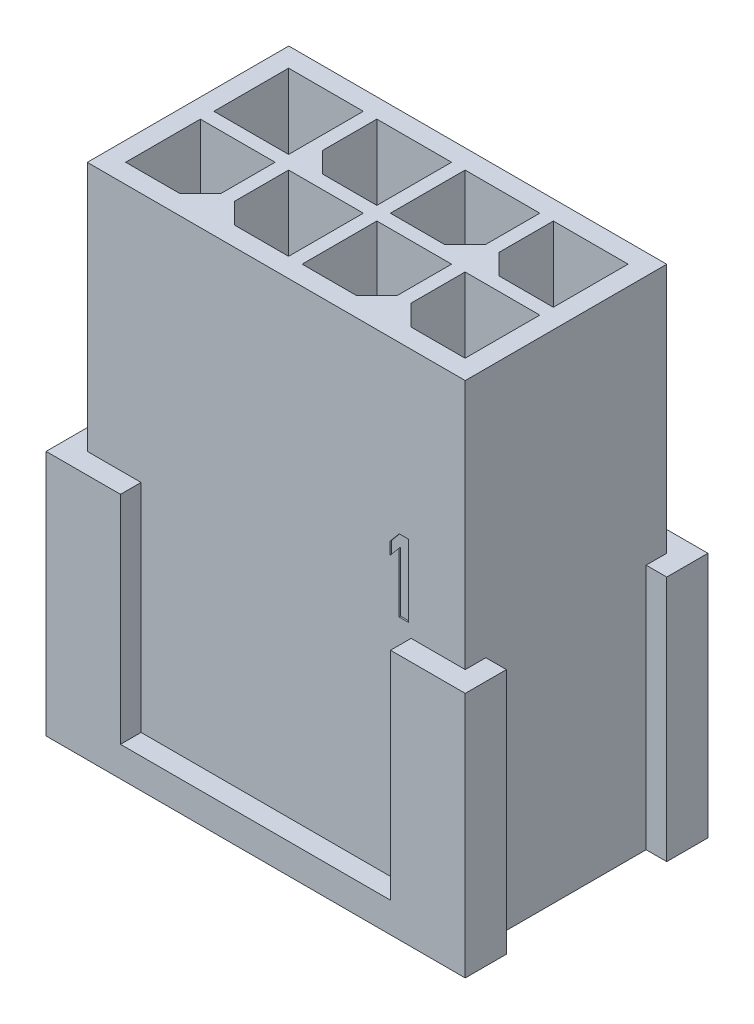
ISO-10303-21;
HEADER;
FILE_DESCRIPTION(('STEP AP214'),'2;1');
FILE_NAME('part.step','',(''),(''),'','','');
FILE_SCHEMA(('AUTOMOTIVE_DESIGN { 1 0 10303 214 1 1 1 1 }'));
ENDSEC;
DATA;
#1=APPLICATION_CONTEXT('core data for automotive mechanical design processes');
#2=APPLICATION_PROTOCOL_DEFINITION('international standard','automotive_design',2000,#1);
#3=PRODUCT_CONTEXT('',#1,'mechanical');
#4=PRODUCT('Part','Part','',(#3));
#5=PRODUCT_RELATED_PRODUCT_CATEGORY('part','',(#4));
#6=PRODUCT_DEFINITION_FORMATION('','',#4);
#7=PRODUCT_DEFINITION_CONTEXT('part definition',#1,'design');
#8=PRODUCT_DEFINITION('design','',#6,#7);
#9=PRODUCT_DEFINITION_SHAPE('','',#8);
#10=(LENGTH_UNIT() NAMED_UNIT(*) SI_UNIT(.MILLI.,.METRE.));
#11=(NAMED_UNIT(*) PLANE_ANGLE_UNIT() SI_UNIT($,.RADIAN.));
#12=(NAMED_UNIT(*) SI_UNIT($,.STERADIAN.) SOLID_ANGLE_UNIT());
#13=UNCERTAINTY_MEASURE_WITH_UNIT(LENGTH_MEASURE(1.E-05),#10,'distance_accuracy_value','');
#14=(GEOMETRIC_REPRESENTATION_CONTEXT(3) GLOBAL_UNCERTAINTY_ASSIGNED_CONTEXT((#13)) GLOBAL_UNIT_ASSIGNED_CONTEXT((#10,
#11,#12)) REPRESENTATION_CONTEXT('',''));
#15=CARTESIAN_POINT('',(0.,0.,0.));
#16=DIRECTION('',(0.,0.,1.));
#17=DIRECTION('',(1.,0.,0.));
#18=AXIS2_PLACEMENT_3D('',#15,#16,#17);
#19=CARTESIAN_POINT('',(-6.42,0.,0.));
#20=DIRECTION('',(1.,0.,0.));
#21=DIRECTION('',(0.,1.,0.));
#22=AXIS2_PLACEMENT_3D('',#19,#20,#21);
#23=PLANE('',#22);
#24=DIRECTION('',(0.,0.,1.));
#25=VECTOR('',#24,1.);
#26=CARTESIAN_POINT('',(-6.42,8.445,-3.425));
#27=LINE('',#26,#25);
#28=CARTESIAN_POINT('',(-6.42,8.445,-3.425));
#29=VERTEX_POINT('',#28);
#30=CARTESIAN_POINT('',(-6.42,8.445,3.425));
#31=VERTEX_POINT('',#30);
#32=EDGE_CURVE('E1113',#29,#31,#27,.T.);
#33=ORIENTED_EDGE('',*,*,#32,.F.);
#34=DIRECTION('',(0.,1.,0.));
#35=VECTOR('',#34,1.);
#36=CARTESIAN_POINT('',(-6.42,-0.065,-3.425));
#37=LINE('',#36,#35);
#38=CARTESIAN_POINT('',(-6.42,-0.065,-3.425));
#39=VERTEX_POINT('',#38);
#40=EDGE_CURVE('E41',#39,#29,#37,.T.);
#41=ORIENTED_EDGE('',*,*,#40,.F.);
#42=DIRECTION('',(0.,0.,1.));
#43=VECTOR('',#42,1.);
#44=CARTESIAN_POINT('',(-6.42,-0.065,-3.425));
#45=LINE('',#44,#43);
#46=CARTESIAN_POINT('',(-6.42,-0.065,-2.725));
#47=VERTEX_POINT('',#46);
#48=EDGE_CURVE('E11',#39,#47,#45,.T.);
#49=ORIENTED_EDGE('',*,*,#48,.T.);
#50=DIRECTION('',(0.,1.,0.));
#51=VECTOR('',#50,1.);
#52=CARTESIAN_POINT('',(-6.42,-8.445,-2.725));
#53=LINE('',#52,#51);
#54=CARTESIAN_POINT('',(-6.42,-8.445,-2.725));
#55=VERTEX_POINT('',#54);
#56=EDGE_CURVE('E669',#55,#47,#53,.T.);
#57=ORIENTED_EDGE('',*,*,#56,.F.);
#58=DIRECTION('',(0.,0.,-1.));
#59=VECTOR('',#58,1.);
#60=CARTESIAN_POINT('',(-6.42,-8.445,2.725));
#61=LINE('',#60,#59);
#62=CARTESIAN_POINT('',(-6.42,-8.445,2.725));
#63=VERTEX_POINT('',#62);
#64=EDGE_CURVE('E672',#63,#55,#61,.T.);
#65=ORIENTED_EDGE('',*,*,#64,.F.);
#66=DIRECTION('',(0.,1.,0.));
#67=VECTOR('',#66,1.);
#68=CARTESIAN_POINT('',(-6.42,-8.445,2.725));
#69=LINE('',#68,#67);
#70=CARTESIAN_POINT('',(-6.42,-0.065,2.725));
#71=VERTEX_POINT('',#70);
#72=EDGE_CURVE('E27',#63,#71,#69,.T.);
#73=ORIENTED_EDGE('',*,*,#72,.T.);
#74=DIRECTION('',(0.,0.,-1.));
#75=VECTOR('',#74,1.);
#76=CARTESIAN_POINT('',(-6.42,-0.065,3.425));
#77=LINE('',#76,#75);
#78=CARTESIAN_POINT('',(-6.42,-0.065,3.425));
#79=VERTEX_POINT('',#78);
#80=EDGE_CURVE('E754',#79,#71,#77,.T.);
#81=ORIENTED_EDGE('',*,*,#80,.F.);
#82=DIRECTION('',(0.,-1.,0.));
#83=VECTOR('',#82,1.);
#84=CARTESIAN_POINT('',(-6.42,8.445,3.425));
#85=LINE('',#84,#83);
#86=EDGE_CURVE('E753',#31,#79,#85,.T.);
#87=ORIENTED_EDGE('',*,*,#86,.F.);
#88=EDGE_LOOP('',(#33,#41,#49,#57,#65,#73,#81,#87));
#89=FACE_BOUND('',#88,.T.);
#90=ADVANCED_FACE('F16',(#89),#23,.F.);
#91=CARTESIAN_POINT('',(-6.42,8.445,3.425));
#92=DIRECTION('',(0.,0.,1.));
#93=DIRECTION('',(1.,0.,0.));
#94=AXIS2_PLACEMENT_3D('',#91,#92,#93);
#95=PLANE('',#94);
#96=DIRECTION('',(0.,-1.,0.));
#97=VECTOR('',#96,1.);
#98=CARTESIAN_POINT('',(-4.59,-0.065,3.425));
#99=LINE('',#98,#97);
#100=CARTESIAN_POINT('',(-4.59,-0.065,3.425));
#101=VERTEX_POINT('',#100);
#102=CARTESIAN_POINT('',(-4.59,-7.425,3.425));
#103=VERTEX_POINT('',#102);
#104=EDGE_CURVE('E1091',#101,#103,#99,.T.);
#105=ORIENTED_EDGE('',*,*,#104,.T.);
#106=DIRECTION('',(1.,0.,0.));
#107=VECTOR('',#106,1.);
#108=CARTESIAN_POINT('',(-4.59,-7.425,3.425));
#109=LINE('',#108,#107);
#110=CARTESIAN_POINT('',(4.59,-7.425,3.425));
#111=VERTEX_POINT('',#110);
#112=EDGE_CURVE('E1095',#103,#111,#109,.T.);
#113=ORIENTED_EDGE('',*,*,#112,.T.);
#114=DIRECTION('',(0.,1.,0.));
#115=VECTOR('',#114,1.);
#116=CARTESIAN_POINT('',(4.59,-7.425,3.425));
#117=LINE('',#116,#115);
#118=CARTESIAN_POINT('',(4.59,-0.065,3.425));
#119=VERTEX_POINT('',#118);
#120=EDGE_CURVE('E1056',#111,#119,#117,.T.);
#121=ORIENTED_EDGE('',*,*,#120,.T.);
#122=DIRECTION('',(-1.,0.,0.));
#123=VECTOR('',#122,1.);
#124=CARTESIAN_POINT('',(6.43,-0.065,3.425));
#125=LINE('',#124,#123);
#126=CARTESIAN_POINT('',(6.43,-0.065,3.425));
#127=VERTEX_POINT('',#126);
#128=EDGE_CURVE('E1153',#127,#119,#125,.T.);
#129=ORIENTED_EDGE('',*,*,#128,.F.);
#130=DIRECTION('',(0.,-1.,0.));
#131=VECTOR('',#130,1.);
#132=CARTESIAN_POINT('',(6.43,8.445,3.425));
#133=LINE('',#132,#131);
#134=CARTESIAN_POINT('',(6.43,8.445,3.425));
#135=VERTEX_POINT('',#134);
#136=EDGE_CURVE('E835',#135,#127,#133,.T.);
#137=ORIENTED_EDGE('',*,*,#136,.F.);
#138=DIRECTION('',(1.,0.,0.));
#139=VECTOR('',#138,1.);
#140=CARTESIAN_POINT('',(-6.42,8.445,3.425));
#141=LINE('',#140,#139);
#142=EDGE_CURVE('E1116',#31,#135,#141,.T.);
#143=ORIENTED_EDGE('',*,*,#142,.F.);
#144=ORIENTED_EDGE('',*,*,#86,.T.);
#145=DIRECTION('',(1.,0.,0.));
#146=VECTOR('',#145,1.);
#147=CARTESIAN_POINT('',(-6.42,-0.065,3.425));
#148=LINE('',#147,#146);
#149=EDGE_CURVE('E749',#79,#101,#148,.T.);
#150=ORIENTED_EDGE('',*,*,#149,.T.);
#151=EDGE_LOOP('',(#105,#113,#121,#129,#137,#143,#144,#150));
#152=FACE_BOUND('',#151,.T.);
#153=DIRECTION('',(1.,0.,0.));
#154=VECTOR('',#153,1.);
#155=CARTESIAN_POINT('',(4.18625,0.36,3.425));
#156=LINE('',#155,#154);
#157=CARTESIAN_POINT('',(4.18625,0.36,3.425));
#158=VERTEX_POINT('',#157);
#159=CARTESIAN_POINT('',(4.4925,0.36,3.425));
#160=VERTEX_POINT('',#159);
#161=EDGE_CURVE('E1274',#158,#160,#156,.T.);
#162=ORIENTED_EDGE('',*,*,#161,.F.);
#163=DIRECTION('',(0.,-1.,0.));
#164=VECTOR('',#163,1.);
#165=CARTESIAN_POINT('',(4.18625,2.392978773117,3.425));
#166=LINE('',#165,#164);
#167=CARTESIAN_POINT('',(4.18625,2.392978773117,3.425));
#168=VERTEX_POINT('',#167);
#169=EDGE_CURVE('E1195',#168,#158,#166,.T.);
#170=ORIENTED_EDGE('',*,*,#169,.F.);
#171=DIRECTION('',(0.64287114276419,0.765974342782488,0.));
#172=VECTOR('',#171,1.);
#173=CARTESIAN_POINT('',(3.88,2.028085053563,3.425));
#174=LINE('',#173,#172);
#175=CARTESIAN_POINT('',(3.88,2.028085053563,3.425));
#176=VERTEX_POINT('',#175);
#177=EDGE_CURVE('E1395',#176,#168,#174,.T.);
#178=ORIENTED_EDGE('',*,*,#177,.F.);
#179=DIRECTION('',(0.,-1.,0.));
#180=VECTOR('',#179,1.);
#181=CARTESIAN_POINT('',(3.88,2.445106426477,3.425));
#182=LINE('',#181,#180);
#183=CARTESIAN_POINT('',(3.88,2.445106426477,3.425));
#184=VERTEX_POINT('',#183);
#185=EDGE_CURVE('E864',#184,#176,#182,.T.);
#186=ORIENTED_EDGE('',*,*,#185,.F.);
#187=DIRECTION('',(-0.642871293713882,-0.765974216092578,0.));
#188=VECTOR('',#187,1.);
#189=CARTESIAN_POINT('',(4.18625,2.81,3.425));
#190=LINE('',#189,#188);
#191=CARTESIAN_POINT('',(4.18625,2.81,3.425));
#192=VERTEX_POINT('',#191);
#193=EDGE_CURVE('E865',#192,#184,#190,.T.);
#194=ORIENTED_EDGE('',*,*,#193,.F.);
#195=DIRECTION('',(-1.,0.,0.));
#196=VECTOR('',#195,1.);
#197=CARTESIAN_POINT('',(4.4925,2.81,3.425));
#198=LINE('',#197,#196);
#199=CARTESIAN_POINT('',(4.4925,2.81,3.425));
#200=VERTEX_POINT('',#199);
#201=EDGE_CURVE('E1236',#200,#192,#198,.T.);
#202=ORIENTED_EDGE('',*,*,#201,.F.);
#203=DIRECTION('',(0.,1.,0.));
#204=VECTOR('',#203,1.);
#205=CARTESIAN_POINT('',(4.4925,0.36,3.425));
#206=LINE('',#205,#204);
#207=EDGE_CURVE('E915',#160,#200,#206,.T.);
#208=ORIENTED_EDGE('',*,*,#207,.F.);
#209=EDGE_LOOP('',(#162,#170,#178,#186,#194,#202,#208));
#210=FACE_BOUND('',#209,.T.);
#211=ADVANCED_FACE('F1607',(#152,#210),#95,.T.);
#212=CARTESIAN_POINT('',(-7.12,-0.065,2.725));
#213=DIRECTION('',(0.,-1.,0.));
#214=DIRECTION('',(0.,0.,-1.));
#215=AXIS2_PLACEMENT_3D('',#212,#213,#214);
#216=PLANE('',#215);
#217=ORIENTED_EDGE('',*,*,#80,.T.);
#218=DIRECTION('',(1.,0.,0.));
#219=VECTOR('',#218,1.);
#220=CARTESIAN_POINT('',(-7.12,-0.065,2.725));
#221=LINE('',#220,#219);
#222=CARTESIAN_POINT('',(-7.12,-0.065,2.725));
#223=VERTEX_POINT('',#222);
#224=EDGE_CURVE('E908',#223,#71,#221,.T.);
#225=ORIENTED_EDGE('',*,*,#224,.F.);
#226=DIRECTION('',(0.,0.,1.));
#227=VECTOR('',#226,1.);
#228=CARTESIAN_POINT('',(-7.12,-0.065,2.725));
#229=LINE('',#228,#227);
#230=CARTESIAN_POINT('',(-7.12,-0.065,4.125));
#231=VERTEX_POINT('',#230);
#232=EDGE_CURVE('E877',#223,#231,#229,.T.);
#233=ORIENTED_EDGE('',*,*,#232,.T.);
#234=DIRECTION('',(1.,0.,0.));
#235=VECTOR('',#234,1.);
#236=CARTESIAN_POINT('',(-7.12,-0.065,4.125));
#237=LINE('',#236,#235);
#238=CARTESIAN_POINT('',(-4.59,-0.065,4.125));
#239=VERTEX_POINT('',#238);
#240=EDGE_CURVE('E962',#231,#239,#237,.T.);
#241=ORIENTED_EDGE('',*,*,#240,.T.);
#242=DIRECTION('',(0.,0.,1.));
#243=VECTOR('',#242,1.);
#244=CARTESIAN_POINT('',(-4.59,-0.065,3.425));
#245=LINE('',#244,#243);
#246=EDGE_CURVE('E795',#101,#239,#245,.T.);
#247=ORIENTED_EDGE('',*,*,#246,.F.);
#248=ORIENTED_EDGE('',*,*,#149,.F.);
#249=EDGE_LOOP('',(#217,#225,#233,#241,#247,#248));
#250=FACE_BOUND('',#249,.T.);
#251=ADVANCED_FACE('F1624',(#250),#216,.F.);
#252=CARTESIAN_POINT('',(-4.59,-0.065,2.725));
#253=DIRECTION('',(-1.,0.,0.));
#254=DIRECTION('',(0.,0.,1.));
#255=AXIS2_PLACEMENT_3D('',#252,#253,#254);
#256=PLANE('',#255);
#257=ORIENTED_EDGE('',*,*,#246,.T.);
#258=DIRECTION('',(0.,-1.,0.));
#259=VECTOR('',#258,1.);
#260=CARTESIAN_POINT('',(-4.59,-0.065,4.125));
#261=LINE('',#260,#259);
#262=CARTESIAN_POINT('',(-4.59,-7.425,4.125));
#263=VERTEX_POINT('',#262);
#264=EDGE_CURVE('E791',#239,#263,#261,.T.);
#265=ORIENTED_EDGE('',*,*,#264,.T.);
#266=DIRECTION('',(0.,0.,1.));
#267=VECTOR('',#266,1.);
#268=CARTESIAN_POINT('',(-4.59,-7.425,3.425));
#269=LINE('',#268,#267);
#270=EDGE_CURVE('E789',#103,#263,#269,.T.);
#271=ORIENTED_EDGE('',*,*,#270,.F.);
#272=ORIENTED_EDGE('',*,*,#104,.F.);
#273=EDGE_LOOP('',(#257,#265,#271,#272));
#274=FACE_BOUND('',#273,.T.);
#275=ADVANCED_FACE('F1620',(#274),#256,.F.);
#276=CARTESIAN_POINT('',(-4.59,-7.425,2.725));
#277=DIRECTION('',(0.,-1.,0.));
#278=DIRECTION('',(0.,0.,-1.));
#279=AXIS2_PLACEMENT_3D('',#276,#277,#278);
#280=PLANE('',#279);
#281=ORIENTED_EDGE('',*,*,#270,.T.);
#282=DIRECTION('',(1.,0.,0.));
#283=VECTOR('',#282,1.);
#284=CARTESIAN_POINT('',(-4.59,-7.425,4.125));
#285=LINE('',#284,#283);
#286=CARTESIAN_POINT('',(4.59,-7.425,4.125));
#287=VERTEX_POINT('',#286);
#288=EDGE_CURVE('E785',#263,#287,#285,.T.);
#289=ORIENTED_EDGE('',*,*,#288,.T.);
#290=DIRECTION('',(0.,0.,1.));
#291=VECTOR('',#290,1.);
#292=CARTESIAN_POINT('',(4.59,-7.425,3.425));
#293=LINE('',#292,#291);
#294=EDGE_CURVE('E790',#111,#287,#293,.T.);
#295=ORIENTED_EDGE('',*,*,#294,.F.);
#296=ORIENTED_EDGE('',*,*,#112,.F.);
#297=EDGE_LOOP('',(#281,#289,#295,#296));
#298=FACE_BOUND('',#297,.T.);
#299=ADVANCED_FACE('F1616',(#298),#280,.F.);
#300=CARTESIAN_POINT('',(4.59,-7.425,2.725));
#301=DIRECTION('',(1.,0.,0.));
#302=DIRECTION('',(0.,1.,0.));
#303=AXIS2_PLACEMENT_3D('',#300,#301,#302);
#304=PLANE('',#303);
#305=ORIENTED_EDGE('',*,*,#294,.T.);
#306=DIRECTION('',(0.,1.,0.));
#307=VECTOR('',#306,1.);
#308=CARTESIAN_POINT('',(4.59,-7.425,4.125));
#309=LINE('',#308,#307);
#310=CARTESIAN_POINT('',(4.59,-0.065,4.125));
#311=VERTEX_POINT('',#310);
#312=EDGE_CURVE('E1117',#287,#311,#309,.T.);
#313=ORIENTED_EDGE('',*,*,#312,.T.);
#314=DIRECTION('',(0.,0.,1.));
#315=VECTOR('',#314,1.);
#316=CARTESIAN_POINT('',(4.59,-0.065,3.425));
#317=LINE('',#316,#315);
#318=EDGE_CURVE('E1121',#119,#311,#317,.T.);
#319=ORIENTED_EDGE('',*,*,#318,.F.);
#320=ORIENTED_EDGE('',*,*,#120,.F.);
#321=EDGE_LOOP('',(#305,#313,#319,#320));
#322=FACE_BOUND('',#321,.T.);
#323=ADVANCED_FACE('F1612',(#322),#304,.F.);
#324=CARTESIAN_POINT('',(4.59,-0.065,2.725));
#325=DIRECTION('',(0.,-1.,0.));
#326=DIRECTION('',(0.,0.,-1.));
#327=AXIS2_PLACEMENT_3D('',#324,#325,#326);
#328=PLANE('',#327);
#329=ORIENTED_EDGE('',*,*,#318,.T.);
#330=DIRECTION('',(1.,0.,0.));
#331=VECTOR('',#330,1.);
#332=CARTESIAN_POINT('',(4.59,-0.065,4.125));
#333=LINE('',#332,#331);
#334=CARTESIAN_POINT('',(7.13,-0.065,4.125));
#335=VERTEX_POINT('',#334);
#336=EDGE_CURVE('E1263',#311,#335,#333,.T.);
#337=ORIENTED_EDGE('',*,*,#336,.T.);
#338=DIRECTION('',(0.,0.,1.));
#339=VECTOR('',#338,1.);
#340=CARTESIAN_POINT('',(7.13,-0.065,2.725));
#341=LINE('',#340,#339);
#342=CARTESIAN_POINT('',(7.13,-0.065,2.725));
#343=VERTEX_POINT('',#342);
#344=EDGE_CURVE('E909',#343,#335,#341,.T.);
#345=ORIENTED_EDGE('',*,*,#344,.F.);
#346=DIRECTION('',(1.,0.,0.));
#347=VECTOR('',#346,1.);
#348=CARTESIAN_POINT('',(6.43,-0.065,2.725));
#349=LINE('',#348,#347);
#350=CARTESIAN_POINT('',(6.43,-0.065,2.725));
#351=VERTEX_POINT('',#350);
#352=EDGE_CURVE('E1024',#351,#343,#349,.T.);
#353=ORIENTED_EDGE('',*,*,#352,.F.);
#354=DIRECTION('',(0.,0.,-1.));
#355=VECTOR('',#354,1.);
#356=CARTESIAN_POINT('',(6.43,-0.065,3.425));
#357=LINE('',#356,#355);
#358=EDGE_CURVE('E1149',#127,#351,#357,.T.);
#359=ORIENTED_EDGE('',*,*,#358,.F.);
#360=ORIENTED_EDGE('',*,*,#128,.T.);
#361=EDGE_LOOP('',(#329,#337,#345,#353,#359,#360));
#362=FACE_BOUND('',#361,.T.);
#363=ADVANCED_FACE('F1587',(#362),#328,.F.);
#364=CARTESIAN_POINT('',(6.43,0.,0.));
#365=DIRECTION('',(1.,0.,0.));
#366=DIRECTION('',(0.,1.,0.));
#367=AXIS2_PLACEMENT_3D('',#364,#365,#366);
#368=PLANE('',#367);
#369=ORIENTED_EDGE('',*,*,#358,.T.);
#370=DIRECTION('',(0.,1.,0.));
#371=VECTOR('',#370,1.);
#372=CARTESIAN_POINT('',(6.43,-8.445,2.725));
#373=LINE('',#372,#371);
#374=CARTESIAN_POINT('',(6.43,-8.445,2.725));
#375=VERTEX_POINT('',#374);
#376=EDGE_CURVE('E1020',#375,#351,#373,.T.);
#377=ORIENTED_EDGE('',*,*,#376,.F.);
#378=DIRECTION('',(0.,0.,-1.));
#379=VECTOR('',#378,1.);
#380=CARTESIAN_POINT('',(6.43,-8.445,2.725));
#381=LINE('',#380,#379);
#382=CARTESIAN_POINT('',(6.43,-8.445,-2.725));
#383=VERTEX_POINT('',#382);
#384=EDGE_CURVE('E1154',#375,#383,#381,.T.);
#385=ORIENTED_EDGE('',*,*,#384,.T.);
#386=DIRECTION('',(0.,1.,0.));
#387=VECTOR('',#386,1.);
#388=CARTESIAN_POINT('',(6.43,-8.445,-2.725));
#389=LINE('',#388,#387);
#390=CARTESIAN_POINT('',(6.43,-0.065,-2.725));
#391=VERTEX_POINT('',#390);
#392=EDGE_CURVE('E20',#383,#391,#389,.T.);
#393=ORIENTED_EDGE('',*,*,#392,.T.);
#394=DIRECTION('',(0.,0.,1.));
#395=VECTOR('',#394,1.);
#396=CARTESIAN_POINT('',(6.43,-0.065,-3.425));
#397=LINE('',#396,#395);
#398=CARTESIAN_POINT('',(6.43,-0.065,-3.425));
#399=VERTEX_POINT('',#398);
#400=EDGE_CURVE('E681',#399,#391,#397,.T.);
#401=ORIENTED_EDGE('',*,*,#400,.F.);
#402=DIRECTION('',(0.,1.,0.));
#403=VECTOR('',#402,1.);
#404=CARTESIAN_POINT('',(6.43,-0.065,-3.425));
#405=LINE('',#404,#403);
#406=CARTESIAN_POINT('',(6.43,8.445,-3.425));
#407=VERTEX_POINT('',#406);
#408=EDGE_CURVE('E834',#399,#407,#405,.T.);
#409=ORIENTED_EDGE('',*,*,#408,.T.);
#410=DIRECTION('',(0.,0.,1.));
#411=VECTOR('',#410,1.);
#412=CARTESIAN_POINT('',(6.43,8.445,-3.425));
#413=LINE('',#412,#411);
#414=EDGE_CURVE('E830',#407,#135,#413,.T.);
#415=ORIENTED_EDGE('',*,*,#414,.T.);
#416=ORIENTED_EDGE('',*,*,#136,.T.);
#417=EDGE_LOOP('',(#369,#377,#385,#393,#401,#409,#415,#416));
#418=FACE_BOUND('',#417,.T.);
#419=ADVANCED_FACE('F1601',(#418),#368,.T.);
#420=CARTESIAN_POINT('',(-6.42,8.445,-3.425));
#421=DIRECTION('',(0.,1.,0.));
#422=DIRECTION('',(1.,0.,0.));
#423=AXIS2_PLACEMENT_3D('',#420,#421,#422);
#424=PLANE('',#423);
#425=ORIENTED_EDGE('',*,*,#142,.T.);
#426=ORIENTED_EDGE('',*,*,#414,.F.);
#427=DIRECTION('',(1.,0.,0.));
#428=VECTOR('',#427,1.);
#429=CARTESIAN_POINT('',(-6.42,8.445,-3.425));
#430=LINE('',#429,#428);
#431=EDGE_CURVE('E947',#29,#407,#430,.T.);
#432=ORIENTED_EDGE('',*,*,#431,.F.);
#433=ORIENTED_EDGE('',*,*,#32,.T.);
#434=EDGE_LOOP('',(#425,#426,#432,#433));
#435=FACE_BOUND('',#434,.T.);
#436=DIRECTION('',(0.,0.,1.));
#437=VECTOR('',#436,1.);
#438=CARTESIAN_POINT('',(3.23,8.445,-2.77));
#439=LINE('',#438,#437);
#440=CARTESIAN_POINT('',(3.23,8.445,-2.77));
#441=VERTEX_POINT('',#440);
#442=CARTESIAN_POINT('',(3.23,8.445,-0.93));
#443=VERTEX_POINT('',#442);
#444=EDGE_CURVE('E891',#441,#443,#439,.T.);
#445=ORIENTED_EDGE('',*,*,#444,.F.);
#446=DIRECTION('',(-1.,0.,0.));
#447=VECTOR('',#446,1.);
#448=CARTESIAN_POINT('',(5.77,8.445,-2.77));
#449=LINE('',#448,#447);
#450=CARTESIAN_POINT('',(5.77,8.445,-2.77));
#451=VERTEX_POINT('',#450);
#452=EDGE_CURVE('E1246',#451,#441,#449,.T.);
#453=ORIENTED_EDGE('',*,*,#452,.F.);
#454=DIRECTION('',(0.,0.,-1.));
#455=VECTOR('',#454,1.);
#456=CARTESIAN_POINT('',(5.77,8.445,-0.23));
#457=LINE('',#456,#455);
#458=CARTESIAN_POINT('',(5.77,8.445,-0.23));
#459=VERTEX_POINT('',#458);
#460=EDGE_CURVE('E1357',#459,#451,#457,.T.);
#461=ORIENTED_EDGE('',*,*,#460,.F.);
#462=DIRECTION('',(1.,0.,0.));
#463=VECTOR('',#462,1.);
#464=CARTESIAN_POINT('',(3.93,8.445,-0.23));
#465=LINE('',#464,#463);
#466=CARTESIAN_POINT('',(3.93,8.445,-0.23));
#467=VERTEX_POINT('',#466);
#468=EDGE_CURVE('E1087',#467,#459,#465,.T.);
#469=ORIENTED_EDGE('',*,*,#468,.F.);
#470=DIRECTION('',(0.707106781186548,0.,0.707106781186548));
#471=VECTOR('',#470,1.);
#472=CARTESIAN_POINT('',(3.23,8.445,-0.93));
#473=LINE('',#472,#471);
#474=EDGE_CURVE('E932',#443,#467,#473,.T.);
#475=ORIENTED_EDGE('',*,*,#474,.F.);
#476=EDGE_LOOP('',(#445,#453,#461,#469,#475));
#477=FACE_BOUND('',#476,.T.);
#478=DIRECTION('',(0.,0.,-1.));
#479=VECTOR('',#478,1.);
#480=CARTESIAN_POINT('',(5.77,8.445,2.77));
#481=LINE('',#480,#479);
#482=CARTESIAN_POINT('',(5.77,8.445,2.77));
#483=VERTEX_POINT('',#482);
#484=CARTESIAN_POINT('',(5.77,8.445,0.23));
#485=VERTEX_POINT('',#484);
#486=EDGE_CURVE('E726',#483,#485,#481,.T.);
#487=ORIENTED_EDGE('',*,*,#486,.F.);
#488=DIRECTION('',(1.,0.,0.));
#489=VECTOR('',#488,1.);
#490=CARTESIAN_POINT('',(3.93,8.445,2.77));
#491=LINE('',#490,#489);
#492=CARTESIAN_POINT('',(3.93,8.445,2.77));
#493=VERTEX_POINT('',#492);
#494=EDGE_CURVE('E727',#493,#483,#491,.T.);
#495=ORIENTED_EDGE('',*,*,#494,.F.);
#496=DIRECTION('',(0.707106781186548,0.,0.707106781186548));
#497=VECTOR('',#496,1.);
#498=CARTESIAN_POINT('',(3.23,8.445,2.07));
#499=LINE('',#498,#497);
#500=CARTESIAN_POINT('',(3.23,8.445,2.07));
#501=VERTEX_POINT('',#500);
#502=EDGE_CURVE('E733',#501,#493,#499,.T.);
#503=ORIENTED_EDGE('',*,*,#502,.F.);
#504=DIRECTION('',(0.,0.,1.));
#505=VECTOR('',#504,1.);
#506=CARTESIAN_POINT('',(3.23,8.445,0.23));
#507=LINE('',#506,#505);
#508=CARTESIAN_POINT('',(3.23,8.445,0.23));
#509=VERTEX_POINT('',#508);
#510=EDGE_CURVE('E1229',#509,#501,#507,.T.);
#511=ORIENTED_EDGE('',*,*,#510,.F.);
#512=DIRECTION('',(-1.,0.,0.));
#513=VECTOR('',#512,1.);
#514=CARTESIAN_POINT('',(5.77,8.445,0.23));
#515=LINE('',#514,#513);
#516=EDGE_CURVE('E1075',#485,#509,#515,.T.);
#517=ORIENTED_EDGE('',*,*,#516,.F.);
#518=EDGE_LOOP('',(#487,#495,#503,#511,#517));
#519=FACE_BOUND('',#518,.T.);
#520=DIRECTION('',(0.,0.,1.));
#521=VECTOR('',#520,1.);
#522=CARTESIAN_POINT('',(-5.77,8.445,0.23));
#523=LINE('',#522,#521);
#524=CARTESIAN_POINT('',(-5.77,8.445,0.23));
#525=VERTEX_POINT('',#524);
#526=CARTESIAN_POINT('',(-5.77,8.445,2.77));
#527=VERTEX_POINT('',#526);
#528=EDGE_CURVE('E1481',#525,#527,#523,.T.);
#529=ORIENTED_EDGE('',*,*,#528,.F.);
#530=DIRECTION('',(-1.,0.,0.));
#531=VECTOR('',#530,1.);
#532=CARTESIAN_POINT('',(-3.23,8.445,0.23));
#533=LINE('',#532,#531);
#534=CARTESIAN_POINT('',(-3.23,8.445,0.23));
#535=VERTEX_POINT('',#534);
#536=EDGE_CURVE('E823',#535,#525,#533,.T.);
#537=ORIENTED_EDGE('',*,*,#536,.F.);
#538=DIRECTION('',(0.,0.,-1.));
#539=VECTOR('',#538,1.);
#540=CARTESIAN_POINT('',(-3.23,8.445,2.07));
#541=LINE('',#540,#539);
#542=CARTESIAN_POINT('',(-3.23,8.445,2.07));
#543=VERTEX_POINT('',#542);
#544=EDGE_CURVE('E824',#543,#535,#541,.T.);
#545=ORIENTED_EDGE('',*,*,#544,.F.);
#546=DIRECTION('',(0.707106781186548,0.,-0.707106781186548));
#547=VECTOR('',#546,1.);
#548=CARTESIAN_POINT('',(-3.93,8.445,2.77));
#549=LINE('',#548,#547);
#550=CARTESIAN_POINT('',(-3.93,8.445,2.77));
#551=VERTEX_POINT('',#550);
#552=EDGE_CURVE('E810',#551,#543,#549,.T.);
#553=ORIENTED_EDGE('',*,*,#552,.F.);
#554=DIRECTION('',(1.,0.,0.));
#555=VECTOR('',#554,1.);
#556=CARTESIAN_POINT('',(-5.77,8.445,2.77));
#557=LINE('',#556,#555);
#558=EDGE_CURVE('E1387',#527,#551,#557,.T.);
#559=ORIENTED_EDGE('',*,*,#558,.F.);
#560=EDGE_LOOP('',(#529,#537,#545,#553,#559));
#561=FACE_BOUND('',#560,.T.);
#562=DIRECTION('',(0.,0.,1.));
#563=VECTOR('',#562,1.);
#564=CARTESIAN_POINT('',(-5.77,8.445,-2.77));
#565=LINE('',#564,#563);
#566=CARTESIAN_POINT('',(-5.77,8.445,-2.77));
#567=VERTEX_POINT('',#566);
#568=CARTESIAN_POINT('',(-5.77,8.445,-0.23));
#569=VERTEX_POINT('',#568);
#570=EDGE_CURVE('E1164',#567,#569,#565,.T.);
#571=ORIENTED_EDGE('',*,*,#570,.F.);
#572=DIRECTION('',(-1.,0.,0.));
#573=VECTOR('',#572,1.);
#574=CARTESIAN_POINT('',(-3.23,8.445,-2.77));
#575=LINE('',#574,#573);
#576=CARTESIAN_POINT('',(-3.23,8.445,-2.77));
#577=VERTEX_POINT('',#576);
#578=EDGE_CURVE('E1251',#577,#567,#575,.T.);
#579=ORIENTED_EDGE('',*,*,#578,.F.);
#580=DIRECTION('',(0.,0.,-1.));
#581=VECTOR('',#580,1.);
#582=CARTESIAN_POINT('',(-3.23,8.445,-0.23));
#583=LINE('',#582,#581);
#584=CARTESIAN_POINT('',(-3.23,8.445,-0.23));
#585=VERTEX_POINT('',#584);
#586=EDGE_CURVE('E1122',#585,#577,#583,.T.);
#587=ORIENTED_EDGE('',*,*,#586,.F.);
#588=DIRECTION('',(1.,0.,0.));
#589=VECTOR('',#588,1.);
#590=CARTESIAN_POINT('',(-5.77,8.445,-0.23));
#591=LINE('',#590,#589);
#592=EDGE_CURVE('E737',#569,#585,#591,.T.);
#593=ORIENTED_EDGE('',*,*,#592,.F.);
#594=EDGE_LOOP('',(#571,#579,#587,#593));
#595=FACE_BOUND('',#594,.T.);
#596=DIRECTION('',(-1.,0.,0.));
#597=VECTOR('',#596,1.);
#598=CARTESIAN_POINT('',(2.77,8.445,0.23));
#599=LINE('',#598,#597);
#600=CARTESIAN_POINT('',(2.77,8.445,0.23));
#601=VERTEX_POINT('',#600);
#602=CARTESIAN_POINT('',(0.23,8.445,0.23));
#603=VERTEX_POINT('',#602);
#604=EDGE_CURVE('E602',#601,#603,#599,.T.);
#605=ORIENTED_EDGE('',*,*,#604,.F.);
#606=DIRECTION('',(0.,0.,-1.));
#607=VECTOR('',#606,1.);
#608=CARTESIAN_POINT('',(2.77,8.445,2.07));
#609=LINE('',#608,#607);
#610=CARTESIAN_POINT('',(2.77,8.445,2.07));
#611=VERTEX_POINT('',#610);
#612=EDGE_CURVE('E728',#611,#601,#609,.T.);
#613=ORIENTED_EDGE('',*,*,#612,.F.);
#614=DIRECTION('',(0.707106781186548,0.,-0.707106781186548));
#615=VECTOR('',#614,1.);
#616=CARTESIAN_POINT('',(2.07,8.445,2.77));
#617=LINE('',#616,#615);
#618=CARTESIAN_POINT('',(2.07,8.445,2.77));
#619=VERTEX_POINT('',#618);
#620=EDGE_CURVE('E758',#619,#611,#617,.T.);
#621=ORIENTED_EDGE('',*,*,#620,.F.);
#622=DIRECTION('',(1.,0.,0.));
#623=VECTOR('',#622,1.);
#624=CARTESIAN_POINT('',(0.23,8.445,2.77));
#625=LINE('',#624,#623);
#626=CARTESIAN_POINT('',(0.23,8.445,2.77));
#627=VERTEX_POINT('',#626);
#628=EDGE_CURVE('E829',#627,#619,#625,.T.);
#629=ORIENTED_EDGE('',*,*,#628,.F.);
#630=DIRECTION('',(0.,0.,1.));
#631=VECTOR('',#630,1.);
#632=CARTESIAN_POINT('',(0.23,8.445,0.23));
#633=LINE('',#632,#631);
#634=EDGE_CURVE('E1220',#603,#627,#633,.T.);
#635=ORIENTED_EDGE('',*,*,#634,.F.);
#636=EDGE_LOOP('',(#605,#613,#621,#629,#635));
#637=FACE_BOUND('',#636,.T.);
#638=DIRECTION('',(0.,0.,1.));
#639=VECTOR('',#638,1.);
#640=CARTESIAN_POINT('',(0.23,8.445,-2.77));
#641=LINE('',#640,#639);
#642=CARTESIAN_POINT('',(0.23,8.445,-2.77));
#643=VERTEX_POINT('',#642);
#644=CARTESIAN_POINT('',(0.23,8.445,-0.23));
#645=VERTEX_POINT('',#644);
#646=EDGE_CURVE('E1369',#643,#645,#641,.T.);
#647=ORIENTED_EDGE('',*,*,#646,.F.);
#648=DIRECTION('',(-1.,0.,0.));
#649=VECTOR('',#648,1.);
#650=CARTESIAN_POINT('',(2.77,8.445,-2.77));
#651=LINE('',#650,#649);
#652=CARTESIAN_POINT('',(2.77,8.445,-2.77));
#653=VERTEX_POINT('',#652);
#654=EDGE_CURVE('E614',#653,#643,#651,.T.);
#655=ORIENTED_EDGE('',*,*,#654,.F.);
#656=DIRECTION('',(0.,0.,-1.));
#657=VECTOR('',#656,1.);
#658=CARTESIAN_POINT('',(2.77,8.445,-0.93));
#659=LINE('',#658,#657);
#660=CARTESIAN_POINT('',(2.77,8.445,-0.93));
#661=VERTEX_POINT('',#660);
#662=EDGE_CURVE('E1037',#661,#653,#659,.T.);
#663=ORIENTED_EDGE('',*,*,#662,.F.);
#664=DIRECTION('',(0.707106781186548,0.,-0.707106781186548));
#665=VECTOR('',#664,1.);
#666=CARTESIAN_POINT('',(2.07,8.445,-0.23));
#667=LINE('',#666,#665);
#668=CARTESIAN_POINT('',(2.07,8.445,-0.23));
#669=VERTEX_POINT('',#668);
#670=EDGE_CURVE('E905',#669,#661,#667,.T.);
#671=ORIENTED_EDGE('',*,*,#670,.F.);
#672=DIRECTION('',(1.,0.,0.));
#673=VECTOR('',#672,1.);
#674=CARTESIAN_POINT('',(0.23,8.445,-0.23));
#675=LINE('',#674,#673);
#676=EDGE_CURVE('E1368',#645,#669,#675,.T.);
#677=ORIENTED_EDGE('',*,*,#676,.F.);
#678=EDGE_LOOP('',(#647,#655,#663,#671,#677));
#679=FACE_BOUND('',#678,.T.);
#680=DIRECTION('',(0.707106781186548,0.,0.707106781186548));
#681=VECTOR('',#680,1.);
#682=CARTESIAN_POINT('',(-2.77,8.445,-0.93));
#683=LINE('',#682,#681);
#684=CARTESIAN_POINT('',(-2.77,8.445,-0.93));
#685=VERTEX_POINT('',#684);
#686=CARTESIAN_POINT('',(-2.07,8.445,-0.23));
#687=VERTEX_POINT('',#686);
#688=EDGE_CURVE('E748',#685,#687,#683,.T.);
#689=ORIENTED_EDGE('',*,*,#688,.F.);
#690=DIRECTION('',(0.,0.,1.));
#691=VECTOR('',#690,1.);
#692=CARTESIAN_POINT('',(-2.77,8.445,-2.77));
#693=LINE('',#692,#691);
#694=CARTESIAN_POINT('',(-2.77,8.445,-2.77));
#695=VERTEX_POINT('',#694);
#696=EDGE_CURVE('E1079',#695,#685,#693,.T.);
#697=ORIENTED_EDGE('',*,*,#696,.F.);
#698=DIRECTION('',(-1.,0.,0.));
#699=VECTOR('',#698,1.);
#700=CARTESIAN_POINT('',(-0.23,8.445,-2.77));
#701=LINE('',#700,#699);
#702=CARTESIAN_POINT('',(-0.23,8.445,-2.77));
#703=VERTEX_POINT('',#702);
#704=EDGE_CURVE('E882',#703,#695,#701,.T.);
#705=ORIENTED_EDGE('',*,*,#704,.F.);
#706=DIRECTION('',(0.,0.,-1.));
#707=VECTOR('',#706,1.);
#708=CARTESIAN_POINT('',(-0.23,8.445,-0.23));
#709=LINE('',#708,#707);
#710=CARTESIAN_POINT('',(-0.23,8.445,-0.23));
#711=VERTEX_POINT('',#710);
#712=EDGE_CURVE('E720',#711,#703,#709,.T.);
#713=ORIENTED_EDGE('',*,*,#712,.F.);
#714=DIRECTION('',(1.,0.,0.));
#715=VECTOR('',#714,1.);
#716=CARTESIAN_POINT('',(-2.07,8.445,-0.23));
#717=LINE('',#716,#715);
#718=EDGE_CURVE('E747',#687,#711,#717,.T.);
#719=ORIENTED_EDGE('',*,*,#718,.F.);
#720=EDGE_LOOP('',(#689,#697,#705,#713,#719));
#721=FACE_BOUND('',#720,.T.);
#722=DIRECTION('',(0.,0.,-1.));
#723=VECTOR('',#722,1.);
#724=CARTESIAN_POINT('',(-0.23,8.445,2.77));
#725=LINE('',#724,#723);
#726=CARTESIAN_POINT('',(-0.23,8.445,2.77));
#727=VERTEX_POINT('',#726);
#728=CARTESIAN_POINT('',(-0.23,8.445,0.23));
#729=VERTEX_POINT('',#728);
#730=EDGE_CURVE('E1013',#727,#729,#725,.T.);
#731=ORIENTED_EDGE('',*,*,#730,.F.);
#732=DIRECTION('',(1.,0.,0.));
#733=VECTOR('',#732,1.);
#734=CARTESIAN_POINT('',(-2.07,8.445,2.77));
#735=LINE('',#734,#733);
#736=CARTESIAN_POINT('',(-2.07,8.445,2.77));
#737=VERTEX_POINT('',#736);
#738=EDGE_CURVE('E973',#737,#727,#735,.T.);
#739=ORIENTED_EDGE('',*,*,#738,.F.);
#740=DIRECTION('',(0.707106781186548,0.,0.707106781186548));
#741=VECTOR('',#740,1.);
#742=CARTESIAN_POINT('',(-2.77,8.445,2.07));
#743=LINE('',#742,#741);
#744=CARTESIAN_POINT('',(-2.77,8.445,2.07));
#745=VERTEX_POINT('',#744);
#746=EDGE_CURVE('E849',#745,#737,#743,.T.);
#747=ORIENTED_EDGE('',*,*,#746,.F.);
#748=DIRECTION('',(0.,0.,1.));
#749=VECTOR('',#748,1.);
#750=CARTESIAN_POINT('',(-2.77,8.445,0.23));
#751=LINE('',#750,#749);
#752=CARTESIAN_POINT('',(-2.77,8.445,0.23));
#753=VERTEX_POINT('',#752);
#754=EDGE_CURVE('E799',#753,#745,#751,.T.);
#755=ORIENTED_EDGE('',*,*,#754,.F.);
#756=DIRECTION('',(-1.,0.,0.));
#757=VECTOR('',#756,1.);
#758=CARTESIAN_POINT('',(-0.23,8.445,0.23));
#759=LINE('',#758,#757);
#760=EDGE_CURVE('E721',#729,#753,#759,.T.);
#761=ORIENTED_EDGE('',*,*,#760,.F.);
#762=EDGE_LOOP('',(#731,#739,#747,#755,#761));
#763=FACE_BOUND('',#762,.T.);
#764=ADVANCED_FACE('F1459',(#435,#477,#519,#561,#595,#637,#679,#721,#763),#424,.T.);
#765=CARTESIAN_POINT('',(-6.42,-8.445,-3.425));
#766=DIRECTION('',(0.,0.,-1.));
#767=DIRECTION('',(0.,-1.,0.));
#768=AXIS2_PLACEMENT_3D('',#765,#766,#767);
#769=PLANE('',#768);
#770=DIRECTION('',(0.,-1.,0.));
#771=VECTOR('',#770,1.);
#772=CARTESIAN_POINT('',(-4.59,-0.065,-3.425));
#773=LINE('',#772,#771);
#774=CARTESIAN_POINT('',(-4.59,-0.065,-3.425));
#775=VERTEX_POINT('',#774);
#776=CARTESIAN_POINT('',(-4.59,-7.425,-3.425));
#777=VERTEX_POINT('',#776);
#778=EDGE_CURVE('E818',#775,#777,#773,.T.);
#779=ORIENTED_EDGE('',*,*,#778,.F.);
#780=DIRECTION('',(1.,0.,0.));
#781=VECTOR('',#780,1.);
#782=CARTESIAN_POINT('',(-6.42,-0.065,-3.425));
#783=LINE('',#782,#781);
#784=EDGE_CURVE('E883',#39,#775,#783,.T.);
#785=ORIENTED_EDGE('',*,*,#784,.F.);
#786=ORIENTED_EDGE('',*,*,#40,.T.);
#787=ORIENTED_EDGE('',*,*,#431,.T.);
#788=ORIENTED_EDGE('',*,*,#408,.F.);
#789=DIRECTION('',(-1.,0.,0.));
#790=VECTOR('',#789,1.);
#791=CARTESIAN_POINT('',(6.43,-0.065,-3.425));
#792=LINE('',#791,#790);
#793=CARTESIAN_POINT('',(4.59,-0.065,-3.425));
#794=VERTEX_POINT('',#793);
#795=EDGE_CURVE('E950',#399,#794,#792,.T.);
#796=ORIENTED_EDGE('',*,*,#795,.T.);
#797=DIRECTION('',(0.,1.,0.));
#798=VECTOR('',#797,1.);
#799=CARTESIAN_POINT('',(4.59,-7.425,-3.425));
#800=LINE('',#799,#798);
#801=CARTESIAN_POINT('',(4.59,-7.425,-3.425));
#802=VERTEX_POINT('',#801);
#803=EDGE_CURVE('E1046',#802,#794,#800,.T.);
#804=ORIENTED_EDGE('',*,*,#803,.F.);
#805=DIRECTION('',(1.,0.,0.));
#806=VECTOR('',#805,1.);
#807=CARTESIAN_POINT('',(1.4,-7.425,-3.425));
#808=LINE('',#807,#806);
#809=CARTESIAN_POINT('',(1.4,-7.425,-3.425));
#810=VERTEX_POINT('',#809);
#811=EDGE_CURVE('E840',#810,#802,#808,.T.);
#812=ORIENTED_EDGE('',*,*,#811,.F.);
#813=DIRECTION('',(0.,-1.,0.));
#814=VECTOR('',#813,1.);
#815=CARTESIAN_POINT('',(1.4,-7.425,-3.425));
#816=LINE('',#815,#814);
#817=CARTESIAN_POINT('',(1.4,-8.445,-3.425));
#818=VERTEX_POINT('',#817);
#819=EDGE_CURVE('E1184',#810,#818,#816,.T.);
#820=ORIENTED_EDGE('',*,*,#819,.T.);
#821=DIRECTION('',(1.,0.,0.));
#822=VECTOR('',#821,1.);
#823=CARTESIAN_POINT('',(-1.4,-8.445,-3.425));
#824=LINE('',#823,#822);
#825=CARTESIAN_POINT('',(-1.4,-8.445,-3.425));
#826=VERTEX_POINT('',#825);
#827=EDGE_CURVE('E853',#826,#818,#824,.T.);
#828=ORIENTED_EDGE('',*,*,#827,.F.);
#829=DIRECTION('',(0.,1.,0.));
#830=VECTOR('',#829,1.);
#831=CARTESIAN_POINT('',(-1.4,-8.445,-3.425));
#832=LINE('',#831,#830);
#833=CARTESIAN_POINT('',(-1.4,-7.425,-3.425));
#834=VERTEX_POINT('',#833);
#835=EDGE_CURVE('E967',#826,#834,#832,.T.);
#836=ORIENTED_EDGE('',*,*,#835,.T.);
#837=DIRECTION('',(1.,0.,0.));
#838=VECTOR('',#837,1.);
#839=CARTESIAN_POINT('',(-4.59,-7.425,-3.425));
#840=LINE('',#839,#838);
#841=EDGE_CURVE('E768',#777,#834,#840,.T.);
#842=ORIENTED_EDGE('',*,*,#841,.F.);
#843=EDGE_LOOP('',(#779,#785,#786,#787,#788,#796,#804,#812,#820,#828,#836,#842));
#844=FACE_BOUND('',#843,.T.);
#845=DIRECTION('',(1.,0.,0.));
#846=VECTOR('',#845,1.);
#847=CARTESIAN_POINT('',(-0.7,4.995,-3.425));
#848=LINE('',#847,#846);
#849=CARTESIAN_POINT('',(-0.7,4.995,-3.425));
#850=VERTEX_POINT('',#849);
#851=CARTESIAN_POINT('',(0.7,4.995,-3.425));
#852=VERTEX_POINT('',#851);
#853=EDGE_CURVE('E963',#850,#852,#848,.T.);
#854=ORIENTED_EDGE('',*,*,#853,.T.);
#855=DIRECTION('',(0.,-1.,0.));
#856=VECTOR('',#855,1.);
#857=CARTESIAN_POINT('',(0.7,7.913455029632,-3.425));
#858=LINE('',#857,#856);
#859=CARTESIAN_POINT('',(0.7,7.913455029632,-3.425));
#860=VERTEX_POINT('',#859);
#861=EDGE_CURVE('E988',#860,#852,#858,.T.);
#862=ORIENTED_EDGE('',*,*,#861,.F.);
#863=DIRECTION('',(1.,0.,0.));
#864=VECTOR('',#863,1.);
#865=CARTESIAN_POINT('',(-0.7,7.913455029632,-3.425));
#866=LINE('',#865,#864);
#867=CARTESIAN_POINT('',(-0.7,7.913455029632,-3.425));
#868=VERTEX_POINT('',#867);
#869=EDGE_CURVE('E759',#868,#860,#866,.T.);
#870=ORIENTED_EDGE('',*,*,#869,.F.);
#871=DIRECTION('',(0.,-1.,0.));
#872=VECTOR('',#871,1.);
#873=CARTESIAN_POINT('',(-0.7,7.913455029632,-3.425));
#874=LINE('',#873,#872);
#875=EDGE_CURVE('E968',#868,#850,#874,.T.);
#876=ORIENTED_EDGE('',*,*,#875,.T.);
#877=EDGE_LOOP('',(#854,#862,#870,#876));
#878=FACE_BOUND('',#877,.T.);
#879=ADVANCED_FACE('F1332',(#844,#878),#769,.T.);
#880=CARTESIAN_POINT('',(-0.7,0.,0.));
#881=DIRECTION('',(1.,0.,0.));
#882=DIRECTION('',(0.,1.,0.));
#883=AXIS2_PLACEMENT_3D('',#880,#881,#882);
#884=PLANE('',#883);
#885=DIRECTION('',(0.,0.766044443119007,0.642787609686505));
#886=VECTOR('',#885,1.);
#887=CARTESIAN_POINT('',(-0.7,6.245,-4.825));
#888=LINE('',#887,#886);
#889=CARTESIAN_POINT('',(-0.7,6.245,-4.825));
#890=VERTEX_POINT('',#889);
#891=EDGE_CURVE('E762',#890,#868,#888,.T.);
#892=ORIENTED_EDGE('',*,*,#891,.F.);
#893=DIRECTION('',(0.,1.,0.));
#894=VECTOR('',#893,1.);
#895=CARTESIAN_POINT('',(-0.7,5.495,-4.825));
#896=LINE('',#895,#894);
#897=CARTESIAN_POINT('',(-0.7,5.495,-4.825));
#898=VERTEX_POINT('',#897);
#899=EDGE_CURVE('E925',#898,#890,#896,.T.);
#900=ORIENTED_EDGE('',*,*,#899,.F.);
#901=DIRECTION('',(0.,0.,-1.));
#902=VECTOR('',#901,1.);
#903=CARTESIAN_POINT('',(-0.7,5.495,-3.925));
#904=LINE('',#903,#902);
#905=CARTESIAN_POINT('',(-0.7,5.495,-3.925));
#906=VERTEX_POINT('',#905);
#907=EDGE_CURVE('E844',#906,#898,#904,.T.);
#908=ORIENTED_EDGE('',*,*,#907,.F.);
#909=CARTESIAN_POINT('',(-0.7,4.995,-3.925));
#910=DIRECTION('',(-1.,0.,0.));
#911=DIRECTION('',(0.,0.,1.));
#912=AXIS2_PLACEMENT_3D('',#909,#910,#911);
#913=CIRCLE('',#912,0.5);
#914=EDGE_CURVE('E1501',#850,#906,#913,.T.);
#915=ORIENTED_EDGE('',*,*,#914,.F.);
#916=ORIENTED_EDGE('',*,*,#875,.F.);
#917=EDGE_LOOP('',(#892,#900,#908,#915,#916));
#918=FACE_BOUND('',#917,.T.);
#919=ADVANCED_FACE('F1873',(#918),#884,.F.);
#920=CARTESIAN_POINT('',(-0.7,4.995,-3.925));
#921=DIRECTION('',(1.,0.,0.));
#922=DIRECTION('',(0.,-1.,0.));
#923=AXIS2_PLACEMENT_3D('',#920,#921,#922);
#924=CYLINDRICAL_SURFACE('',#923,0.5);
#925=ORIENTED_EDGE('',*,*,#914,.T.);
#926=DIRECTION('',(1.,0.,0.));
#927=VECTOR('',#926,1.);
#928=CARTESIAN_POINT('',(-0.7,5.495,-3.925));
#929=LINE('',#928,#927);
#930=CARTESIAN_POINT('',(0.7,5.495,-3.925));
#931=VERTEX_POINT('',#930);
#932=EDGE_CURVE('E1045',#906,#931,#929,.T.);
#933=ORIENTED_EDGE('',*,*,#932,.T.);
#934=CARTESIAN_POINT('',(0.7,4.995,-3.925));
#935=DIRECTION('',(-1.,0.,0.));
#936=DIRECTION('',(0.,0.,1.));
#937=AXIS2_PLACEMENT_3D('',#934,#935,#936);
#938=CIRCLE('',#937,0.5);
#939=EDGE_CURVE('E1042',#852,#931,#938,.T.);
#940=ORIENTED_EDGE('',*,*,#939,.F.);
#941=ORIENTED_EDGE('',*,*,#853,.F.);
#942=EDGE_LOOP('',(#925,#933,#940,#941));
#943=FACE_BOUND('',#942,.T.);
#944=ADVANCED_FACE('F1864',(#943),#924,.F.);
#945=CARTESIAN_POINT('',(0.7,0.,0.));
#946=DIRECTION('',(1.,0.,0.));
#947=DIRECTION('',(0.,1.,0.));
#948=AXIS2_PLACEMENT_3D('',#945,#946,#947);
#949=PLANE('',#948);
#950=ORIENTED_EDGE('',*,*,#939,.T.);
#951=DIRECTION('',(0.,0.,-1.));
#952=VECTOR('',#951,1.);
#953=CARTESIAN_POINT('',(0.7,5.495,-3.925));
#954=LINE('',#953,#952);
#955=CARTESIAN_POINT('',(0.7,5.495,-4.825));
#956=VERTEX_POINT('',#955);
#957=EDGE_CURVE('E941',#931,#956,#954,.T.);
#958=ORIENTED_EDGE('',*,*,#957,.T.);
#959=DIRECTION('',(0.,1.,0.));
#960=VECTOR('',#959,1.);
#961=CARTESIAN_POINT('',(0.7,5.495,-4.825));
#962=LINE('',#961,#960);
#963=CARTESIAN_POINT('',(0.7,6.245,-4.825));
#964=VERTEX_POINT('',#963);
#965=EDGE_CURVE('E937',#956,#964,#962,.T.);
#966=ORIENTED_EDGE('',*,*,#965,.T.);
#967=DIRECTION('',(0.,0.766044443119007,0.642787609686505));
#968=VECTOR('',#967,1.);
#969=CARTESIAN_POINT('',(0.7,6.245,-4.825));
#970=LINE('',#969,#968);
#971=EDGE_CURVE('E942',#964,#860,#970,.T.);
#972=ORIENTED_EDGE('',*,*,#971,.T.);
#973=ORIENTED_EDGE('',*,*,#861,.T.);
#974=EDGE_LOOP('',(#950,#958,#966,#972,#973));
#975=FACE_BOUND('',#974,.T.);
#976=ADVANCED_FACE('F1861',(#975),#949,.T.);
#977=CARTESIAN_POINT('',(-0.7,6.245,-4.825));
#978=DIRECTION('',(0.,0.642787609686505,-0.766044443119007));
#979=DIRECTION('',(-1.,0.,0.));
#980=AXIS2_PLACEMENT_3D('',#977,#978,#979);
#981=PLANE('',#980);
#982=ORIENTED_EDGE('',*,*,#971,.F.);
#983=DIRECTION('',(1.,0.,0.));
#984=VECTOR('',#983,1.);
#985=CARTESIAN_POINT('',(-0.7,6.245,-4.825));
#986=LINE('',#985,#984);
#987=EDGE_CURVE('E763',#890,#964,#986,.T.);
#988=ORIENTED_EDGE('',*,*,#987,.F.);
#989=ORIENTED_EDGE('',*,*,#891,.T.);
#990=ORIENTED_EDGE('',*,*,#869,.T.);
#991=EDGE_LOOP('',(#982,#988,#989,#990));
#992=FACE_BOUND('',#991,.T.);
#993=ADVANCED_FACE('F1863',(#992),#981,.T.);
#994=CARTESIAN_POINT('',(-0.7,5.495,-4.825));
#995=DIRECTION('',(0.,0.,-1.));
#996=DIRECTION('',(0.,-1.,0.));
#997=AXIS2_PLACEMENT_3D('',#994,#995,#996);
#998=PLANE('',#997);
#999=ORIENTED_EDGE('',*,*,#987,.T.);
#1000=ORIENTED_EDGE('',*,*,#965,.F.);
#1001=DIRECTION('',(1.,0.,0.));
#1002=VECTOR('',#1001,1.);
#1003=CARTESIAN_POINT('',(-0.7,5.495,-4.825));
#1004=LINE('',#1003,#1002);
#1005=EDGE_CURVE('E921',#898,#956,#1004,.T.);
#1006=ORIENTED_EDGE('',*,*,#1005,.F.);
#1007=ORIENTED_EDGE('',*,*,#899,.T.);
#1008=EDGE_LOOP('',(#999,#1000,#1006,#1007));
#1009=FACE_BOUND('',#1008,.T.);
#1010=ADVANCED_FACE('F1870',(#1009),#998,.T.);
#1011=CARTESIAN_POINT('',(-0.7,5.495,-3.925));
#1012=DIRECTION('',(0.,-1.,0.));
#1013=DIRECTION('',(0.,0.,-1.));
#1014=AXIS2_PLACEMENT_3D('',#1011,#1012,#1013);
#1015=PLANE('',#1014);
#1016=ORIENTED_EDGE('',*,*,#1005,.T.);
#1017=ORIENTED_EDGE('',*,*,#957,.F.);
#1018=ORIENTED_EDGE('',*,*,#932,.F.);
#1019=ORIENTED_EDGE('',*,*,#907,.T.);
#1020=EDGE_LOOP('',(#1016,#1017,#1018,#1019));
#1021=FACE_BOUND('',#1020,.T.);
#1022=ADVANCED_FACE('F1883',(#1021),#1015,.T.);
#1023=CARTESIAN_POINT('',(-4.59,-7.425,-2.725));
#1024=DIRECTION('',(0.,1.,0.));
#1025=DIRECTION('',(1.,0.,0.));
#1026=AXIS2_PLACEMENT_3D('',#1023,#1024,#1025);
#1027=PLANE('',#1026);
#1028=ORIENTED_EDGE('',*,*,#811,.T.);
#1029=DIRECTION('',(0.,0.,-1.));
#1030=VECTOR('',#1029,1.);
#1031=CARTESIAN_POINT('',(4.59,-7.425,-3.425));
#1032=LINE('',#1031,#1030);
#1033=CARTESIAN_POINT('',(4.59,-7.425,-4.125));
#1034=VERTEX_POINT('',#1033);
#1035=EDGE_CURVE('E845',#802,#1034,#1032,.T.);
#1036=ORIENTED_EDGE('',*,*,#1035,.T.);
#1037=DIRECTION('',(1.,0.,0.));
#1038=VECTOR('',#1037,1.);
#1039=CARTESIAN_POINT('',(1.4,-7.425,-4.125));
#1040=LINE('',#1039,#1038);
#1041=CARTESIAN_POINT('',(1.4,-7.425,-4.125));
#1042=VERTEX_POINT('',#1041);
#1043=EDGE_CURVE('E982',#1042,#1034,#1040,.T.);
#1044=ORIENTED_EDGE('',*,*,#1043,.F.);
#1045=DIRECTION('',(0.,0.,-1.));
#1046=VECTOR('',#1045,1.);
#1047=CARTESIAN_POINT('',(1.4,-7.425,-3.425));
#1048=LINE('',#1047,#1046);
#1049=EDGE_CURVE('E769',#810,#1042,#1048,.T.);
#1050=ORIENTED_EDGE('',*,*,#1049,.F.);
#1051=EDGE_LOOP('',(#1028,#1036,#1044,#1050));
#1052=FACE_BOUND('',#1051,.T.);
#1053=ADVANCED_FACE('F2468',(#1052),#1027,.T.);
#1054=CARTESIAN_POINT('',(-4.59,-7.425,-2.725));
#1055=DIRECTION('',(0.,1.,0.));
#1056=DIRECTION('',(1.,0.,0.));
#1057=AXIS2_PLACEMENT_3D('',#1054,#1055,#1056);
#1058=PLANE('',#1057);
#1059=DIRECTION('',(1.,0.,0.));
#1060=VECTOR('',#1059,1.);
#1061=CARTESIAN_POINT('',(-4.59,-7.425,-4.125));
#1062=LINE('',#1061,#1060);
#1063=CARTESIAN_POINT('',(-4.59,-7.425,-4.125));
#1064=VERTEX_POINT('',#1063);
#1065=CARTESIAN_POINT('',(-1.4,-7.425,-4.125));
#1066=VERTEX_POINT('',#1065);
#1067=EDGE_CURVE('E839',#1064,#1066,#1062,.T.);
#1068=ORIENTED_EDGE('',*,*,#1067,.F.);
#1069=DIRECTION('',(0.,0.,-1.));
#1070=VECTOR('',#1069,1.);
#1071=CARTESIAN_POINT('',(-4.59,-7.425,-3.425));
#1072=LINE('',#1071,#1070);
#1073=EDGE_CURVE('E815',#777,#1064,#1072,.T.);
#1074=ORIENTED_EDGE('',*,*,#1073,.F.);
#1075=ORIENTED_EDGE('',*,*,#841,.T.);
#1076=DIRECTION('',(0.,0.,-1.));
#1077=VECTOR('',#1076,1.);
#1078=CARTESIAN_POINT('',(-1.4,-7.425,-3.425));
#1079=LINE('',#1078,#1077);
#1080=EDGE_CURVE('E764',#834,#1066,#1079,.T.);
#1081=ORIENTED_EDGE('',*,*,#1080,.T.);
#1082=EDGE_LOOP('',(#1068,#1074,#1075,#1081));
#1083=FACE_BOUND('',#1082,.T.);
#1084=ADVANCED_FACE('F1338',(#1083),#1058,.T.);
#1085=CARTESIAN_POINT('',(1.4,-7.425,-4.125));
#1086=DIRECTION('',(1.,0.,0.));
#1087=DIRECTION('',(0.,1.,0.));
#1088=AXIS2_PLACEMENT_3D('',#1085,#1086,#1087);
#1089=PLANE('',#1088);
#1090=ORIENTED_EDGE('',*,*,#819,.F.);
#1091=ORIENTED_EDGE('',*,*,#1049,.T.);
#1092=DIRECTION('',(0.,1.,0.));
#1093=VECTOR('',#1092,1.);
#1094=CARTESIAN_POINT('',(1.4,-8.445,-4.125));
#1095=LINE('',#1094,#1093);
#1096=CARTESIAN_POINT('',(1.4,-8.445,-4.125));
#1097=VERTEX_POINT('',#1096);
#1098=EDGE_CURVE('E912',#1097,#1042,#1095,.T.);
#1099=ORIENTED_EDGE('',*,*,#1098,.F.);
#1100=DIRECTION('',(0.,0.,1.));
#1101=VECTOR('',#1100,1.);
#1102=CARTESIAN_POINT('',(1.4,-8.445,-4.125));
#1103=LINE('',#1102,#1101);
#1104=EDGE_CURVE('E1191',#1097,#818,#1103,.T.);
#1105=ORIENTED_EDGE('',*,*,#1104,.T.);
#1106=EDGE_LOOP('',(#1090,#1091,#1099,#1105));
#1107=FACE_BOUND('',#1106,.T.);
#1108=ADVANCED_FACE('F2447',(#1107),#1089,.F.);
#1109=CARTESIAN_POINT('',(-6.42,-8.445,3.425));
#1110=DIRECTION('',(0.,-1.,0.));
#1111=DIRECTION('',(0.,0.,-1.));
#1112=AXIS2_PLACEMENT_3D('',#1109,#1110,#1111);
#1113=PLANE('',#1112);
#1114=ORIENTED_EDGE('',*,*,#1104,.F.);
#1115=DIRECTION('',(-1.,0.,0.));
#1116=VECTOR('',#1115,1.);
#1117=CARTESIAN_POINT('',(7.13,-8.445,-4.125));
#1118=LINE('',#1117,#1116);
#1119=CARTESIAN_POINT('',(7.13,-8.445,-4.125));
#1120=VERTEX_POINT('',#1119);
#1121=EDGE_CURVE('E1139',#1120,#1097,#1118,.T.);
#1122=ORIENTED_EDGE('',*,*,#1121,.F.);
#1123=DIRECTION('',(0.,0.,-1.));
#1124=VECTOR('',#1123,1.);
#1125=CARTESIAN_POINT('',(7.13,-8.445,-2.725));
#1126=LINE('',#1125,#1124);
#1127=CARTESIAN_POINT('',(7.13,-8.445,-2.725));
#1128=VERTEX_POINT('',#1127);
#1129=EDGE_CURVE('E836',#1128,#1120,#1126,.T.);
#1130=ORIENTED_EDGE('',*,*,#1129,.F.);
#1131=DIRECTION('',(-1.,0.,0.));
#1132=VECTOR('',#1131,1.);
#1133=CARTESIAN_POINT('',(7.13,-8.445,-2.725));
#1134=LINE('',#1133,#1132);
#1135=EDGE_CURVE('E1292',#1128,#383,#1134,.T.);
#1136=ORIENTED_EDGE('',*,*,#1135,.T.);
#1137=ORIENTED_EDGE('',*,*,#384,.F.);
#1138=DIRECTION('',(-1.,0.,0.));
#1139=VECTOR('',#1138,1.);
#1140=CARTESIAN_POINT('',(7.13,-8.445,2.725));
#1141=LINE('',#1140,#1139);
#1142=CARTESIAN_POINT('',(7.13,-8.445,2.725));
#1143=VERTEX_POINT('',#1142);
#1144=EDGE_CURVE('E854',#1143,#375,#1141,.T.);
#1145=ORIENTED_EDGE('',*,*,#1144,.F.);
#1146=DIRECTION('',(0.,0.,1.));
#1147=VECTOR('',#1146,1.);
#1148=CARTESIAN_POINT('',(7.13,-8.445,2.725));
#1149=LINE('',#1148,#1147);
#1150=CARTESIAN_POINT('',(7.13,-8.445,4.125));
#1151=VERTEX_POINT('',#1150);
#1152=EDGE_CURVE('E931',#1143,#1151,#1149,.T.);
#1153=ORIENTED_EDGE('',*,*,#1152,.T.);
#1154=DIRECTION('',(-1.,0.,0.));
#1155=VECTOR('',#1154,1.);
#1156=CARTESIAN_POINT('',(7.13,-8.445,4.125));
#1157=LINE('',#1156,#1155);
#1158=CARTESIAN_POINT('',(-7.12,-8.445,4.125));
#1159=VERTEX_POINT('',#1158);
#1160=EDGE_CURVE('E694',#1151,#1159,#1157,.T.);
#1161=ORIENTED_EDGE('',*,*,#1160,.T.);
#1162=DIRECTION('',(0.,0.,1.));
#1163=VECTOR('',#1162,1.);
#1164=CARTESIAN_POINT('',(-7.12,-8.445,2.725));
#1165=LINE('',#1164,#1163);
#1166=CARTESIAN_POINT('',(-7.12,-8.445,2.725));
#1167=VERTEX_POINT('',#1166);
#1168=EDGE_CURVE('E1057',#1167,#1159,#1165,.T.);
#1169=ORIENTED_EDGE('',*,*,#1168,.F.);
#1170=DIRECTION('',(-1.,0.,0.));
#1171=VECTOR('',#1170,1.);
#1172=CARTESIAN_POINT('',(-6.42,-8.445,2.725));
#1173=LINE('',#1172,#1171);
#1174=EDGE_CURVE('E692',#63,#1167,#1173,.T.);
#1175=ORIENTED_EDGE('',*,*,#1174,.F.);
#1176=ORIENTED_EDGE('',*,*,#64,.T.);
#1177=DIRECTION('',(-1.,0.,0.));
#1178=VECTOR('',#1177,1.);
#1179=CARTESIAN_POINT('',(-6.42,-8.445,-2.725));
#1180=LINE('',#1179,#1178);
#1181=CARTESIAN_POINT('',(-7.12,-8.445,-2.725));
#1182=VERTEX_POINT('',#1181);
#1183=EDGE_CURVE('E689',#55,#1182,#1180,.T.);
#1184=ORIENTED_EDGE('',*,*,#1183,.T.);
#1185=DIRECTION('',(0.,0.,-1.));
#1186=VECTOR('',#1185,1.);
#1187=CARTESIAN_POINT('',(-7.12,-8.445,-2.725));
#1188=LINE('',#1187,#1186);
#1189=CARTESIAN_POINT('',(-7.12,-8.445,-4.125));
#1190=VERTEX_POINT('',#1189);
#1191=EDGE_CURVE('E699',#1182,#1190,#1188,.T.);
#1192=ORIENTED_EDGE('',*,*,#1191,.T.);
#1193=DIRECTION('',(-1.,0.,0.));
#1194=VECTOR('',#1193,1.);
#1195=CARTESIAN_POINT('',(-1.4,-8.445,-4.125));
#1196=LINE('',#1195,#1194);
#1197=CARTESIAN_POINT('',(-1.4,-8.445,-4.125));
#1198=VERTEX_POINT('',#1197);
#1199=EDGE_CURVE('E910',#1198,#1190,#1196,.T.);
#1200=ORIENTED_EDGE('',*,*,#1199,.F.);
#1201=DIRECTION('',(0.,0.,1.));
#1202=VECTOR('',#1201,1.);
#1203=CARTESIAN_POINT('',(-1.4,-8.445,-4.125));
#1204=LINE('',#1203,#1202);
#1205=EDGE_CURVE('E705',#1198,#826,#1204,.T.);
#1206=ORIENTED_EDGE('',*,*,#1205,.T.);
#1207=ORIENTED_EDGE('',*,*,#827,.T.);
#1208=EDGE_LOOP('',(#1114,#1122,#1130,#1136,#1137,#1145,#1153,#1161,#1169,#1175,#1176,#1184,
#1192,#1200,#1206,#1207));
#1209=FACE_BOUND('',#1208,.T.);
#1210=ADVANCED_FACE('F687',(#1209),#1113,.T.);
#1211=CARTESIAN_POINT('',(-1.4,-8.445,-4.125));
#1212=DIRECTION('',(-1.,0.,0.));
#1213=DIRECTION('',(0.,0.,1.));
#1214=AXIS2_PLACEMENT_3D('',#1211,#1212,#1213);
#1215=PLANE('',#1214);
#1216=DIRECTION('',(0.,1.,0.));
#1217=VECTOR('',#1216,1.);
#1218=CARTESIAN_POINT('',(-1.4,-8.445,-4.125));
#1219=LINE('',#1218,#1217);
#1220=EDGE_CURVE('E978',#1198,#1066,#1219,.T.);
#1221=ORIENTED_EDGE('',*,*,#1220,.T.);
#1222=ORIENTED_EDGE('',*,*,#1080,.F.);
#1223=ORIENTED_EDGE('',*,*,#835,.F.);
#1224=ORIENTED_EDGE('',*,*,#1205,.F.);
#1225=EDGE_LOOP('',(#1221,#1222,#1223,#1224));
#1226=FACE_BOUND('',#1225,.T.);
#1227=ADVANCED_FACE('F1811',(#1226),#1215,.F.);
#1228=CARTESIAN_POINT('',(-6.42,-8.445,-4.125));
#1229=DIRECTION('',(0.,0.,-1.));
#1230=DIRECTION('',(0.,-1.,0.));
#1231=AXIS2_PLACEMENT_3D('',#1228,#1229,#1230);
#1232=PLANE('',#1231);
#1233=ORIENTED_EDGE('',*,*,#1043,.T.);
#1234=DIRECTION('',(0.,1.,0.));
#1235=VECTOR('',#1234,1.);
#1236=CARTESIAN_POINT('',(4.59,-7.425,-4.125));
#1237=LINE('',#1236,#1235);
#1238=CARTESIAN_POINT('',(4.59,-0.065,-4.125));
#1239=VERTEX_POINT('',#1238);
#1240=EDGE_CURVE('E997',#1034,#1239,#1237,.T.);
#1241=ORIENTED_EDGE('',*,*,#1240,.T.);
#1242=DIRECTION('',(1.,0.,0.));
#1243=VECTOR('',#1242,1.);
#1244=CARTESIAN_POINT('',(4.59,-0.065,-4.125));
#1245=LINE('',#1244,#1243);
#1246=CARTESIAN_POINT('',(7.13,-0.065,-4.125));
#1247=VERTEX_POINT('',#1246);
#1248=EDGE_CURVE('E993',#1239,#1247,#1245,.T.);
#1249=ORIENTED_EDGE('',*,*,#1248,.T.);
#1250=DIRECTION('',(0.,-1.,0.));
#1251=VECTOR('',#1250,1.);
#1252=CARTESIAN_POINT('',(7.13,-0.065,-4.125));
#1253=LINE('',#1252,#1251);
#1254=EDGE_CURVE('E998',#1247,#1120,#1253,.T.);
#1255=ORIENTED_EDGE('',*,*,#1254,.T.);
#1256=ORIENTED_EDGE('',*,*,#1121,.T.);
#1257=ORIENTED_EDGE('',*,*,#1098,.T.);
#1258=EDGE_LOOP('',(#1233,#1241,#1249,#1255,#1256,#1257));
#1259=FACE_BOUND('',#1258,.T.);
#1260=ADVANCED_FACE('F2419',(#1259),#1232,.T.);
#1261=CARTESIAN_POINT('',(-6.42,-8.445,-4.125));
#1262=DIRECTION('',(0.,0.,-1.));
#1263=DIRECTION('',(0.,-1.,0.));
#1264=AXIS2_PLACEMENT_3D('',#1261,#1262,#1263);
#1265=PLANE('',#1264);
#1266=ORIENTED_EDGE('',*,*,#1199,.T.);
#1267=DIRECTION('',(0.,1.,0.));
#1268=VECTOR('',#1267,1.);
#1269=CARTESIAN_POINT('',(-7.12,-8.445,-4.125));
#1270=LINE('',#1269,#1268);
#1271=CARTESIAN_POINT('',(-7.12,-0.065,-4.125));
#1272=VERTEX_POINT('',#1271);
#1273=EDGE_CURVE('E913',#1190,#1272,#1270,.T.);
#1274=ORIENTED_EDGE('',*,*,#1273,.T.);
#1275=DIRECTION('',(1.,0.,0.));
#1276=VECTOR('',#1275,1.);
#1277=CARTESIAN_POINT('',(-7.12,-0.065,-4.125));
#1278=LINE('',#1277,#1276);
#1279=CARTESIAN_POINT('',(-4.59,-0.065,-4.125));
#1280=VERTEX_POINT('',#1279);
#1281=EDGE_CURVE('E977',#1272,#1280,#1278,.T.);
#1282=ORIENTED_EDGE('',*,*,#1281,.T.);
#1283=DIRECTION('',(0.,-1.,0.));
#1284=VECTOR('',#1283,1.);
#1285=CARTESIAN_POINT('',(-4.59,-0.065,-4.125));
#1286=LINE('',#1285,#1284);
#1287=EDGE_CURVE('E1260',#1280,#1064,#1286,.T.);
#1288=ORIENTED_EDGE('',*,*,#1287,.T.);
#1289=ORIENTED_EDGE('',*,*,#1067,.T.);
#1290=ORIENTED_EDGE('',*,*,#1220,.F.);
#1291=EDGE_LOOP('',(#1266,#1274,#1282,#1288,#1289,#1290));
#1292=FACE_BOUND('',#1291,.T.);
#1293=ADVANCED_FACE('F1344',(#1292),#1265,.T.);
#1294=CARTESIAN_POINT('',(7.13,-0.065,-2.725));
#1295=DIRECTION('',(1.,0.,0.));
#1296=DIRECTION('',(0.,1.,0.));
#1297=AXIS2_PLACEMENT_3D('',#1294,#1295,#1296);
#1298=PLANE('',#1297);
#1299=ORIENTED_EDGE('',*,*,#1129,.T.);
#1300=ORIENTED_EDGE('',*,*,#1254,.F.);
#1301=DIRECTION('',(0.,0.,-1.));
#1302=VECTOR('',#1301,1.);
#1303=CARTESIAN_POINT('',(7.13,-0.065,-2.725));
#1304=LINE('',#1303,#1302);
#1305=CARTESIAN_POINT('',(7.13,-0.065,-2.725));
#1306=VERTEX_POINT('',#1305);
#1307=EDGE_CURVE('E1301',#1306,#1247,#1304,.T.);
#1308=ORIENTED_EDGE('',*,*,#1307,.F.);
#1309=DIRECTION('',(0.,-1.,0.));
#1310=VECTOR('',#1309,1.);
#1311=CARTESIAN_POINT('',(7.13,-0.065,-2.725));
#1312=LINE('',#1311,#1310);
#1313=EDGE_CURVE('E680',#1306,#1128,#1312,.T.);
#1314=ORIENTED_EDGE('',*,*,#1313,.T.);
#1315=EDGE_LOOP('',(#1299,#1300,#1308,#1314));
#1316=FACE_BOUND('',#1315,.T.);
#1317=ADVANCED_FACE('F1834',(#1316),#1298,.T.);
#1318=CARTESIAN_POINT('',(-6.42,-8.445,-2.725));
#1319=DIRECTION('',(0.,0.,-1.));
#1320=DIRECTION('',(0.,-1.,0.));
#1321=AXIS2_PLACEMENT_3D('',#1318,#1319,#1320);
#1322=PLANE('',#1321);
#1323=ORIENTED_EDGE('',*,*,#392,.F.);
#1324=ORIENTED_EDGE('',*,*,#1135,.F.);
#1325=ORIENTED_EDGE('',*,*,#1313,.F.);
#1326=DIRECTION('',(1.,0.,0.));
#1327=VECTOR('',#1326,1.);
#1328=CARTESIAN_POINT('',(6.43,-0.065,-2.725));
#1329=LINE('',#1328,#1327);
#1330=EDGE_CURVE('E1180',#391,#1306,#1329,.T.);
#1331=ORIENTED_EDGE('',*,*,#1330,.F.);
#1332=EDGE_LOOP('',(#1323,#1324,#1325,#1331));
#1333=FACE_BOUND('',#1332,.T.);
#1334=ADVANCED_FACE('F1635',(#1333),#1322,.F.);
#1335=CARTESIAN_POINT('',(-6.42,-8.445,-2.725));
#1336=DIRECTION('',(0.,0.,-1.));
#1337=DIRECTION('',(0.,-1.,0.));
#1338=AXIS2_PLACEMENT_3D('',#1335,#1336,#1337);
#1339=PLANE('',#1338);
#1340=DIRECTION('',(0.,1.,0.));
#1341=VECTOR('',#1340,1.);
#1342=CARTESIAN_POINT('',(-7.12,-8.445,-2.725));
#1343=LINE('',#1342,#1341);
#1344=CARTESIAN_POINT('',(-7.12,-0.065,-2.725));
#1345=VERTEX_POINT('',#1344);
#1346=EDGE_CURVE('E697',#1182,#1345,#1343,.T.);
#1347=ORIENTED_EDGE('',*,*,#1346,.F.);
#1348=ORIENTED_EDGE('',*,*,#1183,.F.);
#1349=ORIENTED_EDGE('',*,*,#56,.T.);
#1350=DIRECTION('',(1.,0.,0.));
#1351=VECTOR('',#1350,1.);
#1352=CARTESIAN_POINT('',(-7.12,-0.065,-2.725));
#1353=LINE('',#1352,#1351);
#1354=EDGE_CURVE('E887',#1345,#47,#1353,.T.);
#1355=ORIENTED_EDGE('',*,*,#1354,.F.);
#1356=EDGE_LOOP('',(#1347,#1348,#1349,#1355));
#1357=FACE_BOUND('',#1356,.T.);
#1358=ADVANCED_FACE('F696',(#1357),#1339,.F.);
#1359=CARTESIAN_POINT('',(4.59,-0.065,-2.725));
#1360=DIRECTION('',(0.,1.,0.));
#1361=DIRECTION('',(1.,0.,0.));
#1362=AXIS2_PLACEMENT_3D('',#1359,#1360,#1361);
#1363=PLANE('',#1362);
#1364=ORIENTED_EDGE('',*,*,#400,.T.);
#1365=ORIENTED_EDGE('',*,*,#1330,.T.);
#1366=ORIENTED_EDGE('',*,*,#1307,.T.);
#1367=ORIENTED_EDGE('',*,*,#1248,.F.);
#1368=DIRECTION('',(0.,0.,-1.));
#1369=VECTOR('',#1368,1.);
#1370=CARTESIAN_POINT('',(4.59,-0.065,-3.425));
#1371=LINE('',#1370,#1369);
#1372=EDGE_CURVE('E1049',#794,#1239,#1371,.T.);
#1373=ORIENTED_EDGE('',*,*,#1372,.F.);
#1374=ORIENTED_EDGE('',*,*,#795,.F.);
#1375=EDGE_LOOP('',(#1364,#1365,#1366,#1367,#1373,#1374));
#1376=FACE_BOUND('',#1375,.T.);
#1377=ADVANCED_FACE('F1637',(#1376),#1363,.T.);
#1378=CARTESIAN_POINT('',(4.59,-7.425,-2.725));
#1379=DIRECTION('',(-1.,0.,0.));
#1380=DIRECTION('',(0.,0.,1.));
#1381=AXIS2_PLACEMENT_3D('',#1378,#1379,#1380);
#1382=PLANE('',#1381);
#1383=ORIENTED_EDGE('',*,*,#1372,.T.);
#1384=ORIENTED_EDGE('',*,*,#1240,.F.);
#1385=ORIENTED_EDGE('',*,*,#1035,.F.);
#1386=ORIENTED_EDGE('',*,*,#803,.T.);
#1387=EDGE_LOOP('',(#1383,#1384,#1385,#1386));
#1388=FACE_BOUND('',#1387,.T.);
#1389=ADVANCED_FACE('F1819',(#1388),#1382,.T.);
#1390=CARTESIAN_POINT('',(-7.12,-0.065,-2.725));
#1391=DIRECTION('',(0.,1.,0.));
#1392=DIRECTION('',(1.,0.,0.));
#1393=AXIS2_PLACEMENT_3D('',#1390,#1391,#1392);
#1394=PLANE('',#1393);
#1395=DIRECTION('',(0.,0.,-1.));
#1396=VECTOR('',#1395,1.);
#1397=CARTESIAN_POINT('',(-4.59,-0.065,-3.425));
#1398=LINE('',#1397,#1396);
#1399=EDGE_CURVE('E1050',#775,#1280,#1398,.T.);
#1400=ORIENTED_EDGE('',*,*,#1399,.T.);
#1401=ORIENTED_EDGE('',*,*,#1281,.F.);
#1402=DIRECTION('',(0.,0.,-1.));
#1403=VECTOR('',#1402,1.);
#1404=CARTESIAN_POINT('',(-7.12,-0.065,-2.725));
#1405=LINE('',#1404,#1403);
#1406=EDGE_CURVE('E888',#1345,#1272,#1405,.T.);
#1407=ORIENTED_EDGE('',*,*,#1406,.F.);
#1408=ORIENTED_EDGE('',*,*,#1354,.T.);
#1409=ORIENTED_EDGE('',*,*,#48,.F.);
#1410=ORIENTED_EDGE('',*,*,#784,.T.);
#1411=EDGE_LOOP('',(#1400,#1401,#1407,#1408,#1409,#1410));
#1412=FACE_BOUND('',#1411,.T.);
#1413=ADVANCED_FACE('F1817',(#1412),#1394,.T.);
#1414=CARTESIAN_POINT('',(-7.12,-8.445,-2.725));
#1415=DIRECTION('',(-1.,0.,0.));
#1416=DIRECTION('',(0.,0.,1.));
#1417=AXIS2_PLACEMENT_3D('',#1414,#1415,#1416);
#1418=PLANE('',#1417);
#1419=ORIENTED_EDGE('',*,*,#1406,.T.);
#1420=ORIENTED_EDGE('',*,*,#1273,.F.);
#1421=ORIENTED_EDGE('',*,*,#1191,.F.);
#1422=ORIENTED_EDGE('',*,*,#1346,.T.);
#1423=EDGE_LOOP('',(#1419,#1420,#1421,#1422));
#1424=FACE_BOUND('',#1423,.T.);
#1425=ADVANCED_FACE('F1815',(#1424),#1418,.T.);
#1426=CARTESIAN_POINT('',(-4.59,-0.065,-2.725));
#1427=DIRECTION('',(1.,0.,0.));
#1428=DIRECTION('',(0.,1.,0.));
#1429=AXIS2_PLACEMENT_3D('',#1426,#1427,#1428);
#1430=PLANE('',#1429);
#1431=ORIENTED_EDGE('',*,*,#1073,.T.);
#1432=ORIENTED_EDGE('',*,*,#1287,.F.);
#1433=ORIENTED_EDGE('',*,*,#1399,.F.);
#1434=ORIENTED_EDGE('',*,*,#778,.T.);
#1435=EDGE_LOOP('',(#1431,#1432,#1433,#1434));
#1436=FACE_BOUND('',#1435,.T.);
#1437=ADVANCED_FACE('F1328',(#1436),#1430,.T.);
#1438=CARTESIAN_POINT('',(-6.42,-8.445,2.725));
#1439=DIRECTION('',(0.,0.,-1.));
#1440=DIRECTION('',(0.,-1.,0.));
#1441=AXIS2_PLACEMENT_3D('',#1438,#1439,#1440);
#1442=PLANE('',#1441);
#1443=ORIENTED_EDGE('',*,*,#376,.T.);
#1444=ORIENTED_EDGE('',*,*,#352,.T.);
#1445=DIRECTION('',(0.,-1.,0.));
#1446=VECTOR('',#1445,1.);
#1447=CARTESIAN_POINT('',(7.13,-0.065,2.725));
#1448=LINE('',#1447,#1446);
#1449=EDGE_CURVE('E858',#343,#1143,#1448,.T.);
#1450=ORIENTED_EDGE('',*,*,#1449,.T.);
#1451=ORIENTED_EDGE('',*,*,#1144,.T.);
#1452=EDGE_LOOP('',(#1443,#1444,#1450,#1451));
#1453=FACE_BOUND('',#1452,.T.);
#1454=ADVANCED_FACE('F1598',(#1453),#1442,.T.);
#1455=CARTESIAN_POINT('',(-6.42,-8.445,2.725));
#1456=DIRECTION('',(0.,0.,-1.));
#1457=DIRECTION('',(0.,-1.,0.));
#1458=AXIS2_PLACEMENT_3D('',#1455,#1456,#1457);
#1459=PLANE('',#1458);
#1460=DIRECTION('',(0.,1.,0.));
#1461=VECTOR('',#1460,1.);
#1462=CARTESIAN_POINT('',(-7.12,-8.445,2.725));
#1463=LINE('',#1462,#1461);
#1464=EDGE_CURVE('E859',#1167,#223,#1463,.T.);
#1465=ORIENTED_EDGE('',*,*,#1464,.T.);
#1466=ORIENTED_EDGE('',*,*,#224,.T.);
#1467=ORIENTED_EDGE('',*,*,#72,.F.);
#1468=ORIENTED_EDGE('',*,*,#1174,.T.);
#1469=EDGE_LOOP('',(#1465,#1466,#1467,#1468));
#1470=FACE_BOUND('',#1469,.T.);
#1471=ADVANCED_FACE('F1645',(#1470),#1459,.T.);
#1472=CARTESIAN_POINT('',(7.13,-0.065,2.725));
#1473=DIRECTION('',(-1.,0.,0.));
#1474=DIRECTION('',(0.,0.,1.));
#1475=AXIS2_PLACEMENT_3D('',#1472,#1473,#1474);
#1476=PLANE('',#1475);
#1477=ORIENTED_EDGE('',*,*,#344,.T.);
#1478=DIRECTION('',(0.,-1.,0.));
#1479=VECTOR('',#1478,1.);
#1480=CARTESIAN_POINT('',(7.13,-0.065,4.125));
#1481=LINE('',#1480,#1479);
#1482=EDGE_CURVE('E1060',#335,#1151,#1481,.T.);
#1483=ORIENTED_EDGE('',*,*,#1482,.T.);
#1484=ORIENTED_EDGE('',*,*,#1152,.F.);
#1485=ORIENTED_EDGE('',*,*,#1449,.F.);
#1486=EDGE_LOOP('',(#1477,#1483,#1484,#1485));
#1487=FACE_BOUND('',#1486,.T.);
#1488=ADVANCED_FACE('F1595',(#1487),#1476,.F.);
#1489=CARTESIAN_POINT('',(-6.42,-8.445,4.125));
#1490=DIRECTION('',(0.,0.,-1.));
#1491=DIRECTION('',(0.,-1.,0.));
#1492=AXIS2_PLACEMENT_3D('',#1489,#1490,#1491);
#1493=PLANE('',#1492);
#1494=ORIENTED_EDGE('',*,*,#336,.F.);
#1495=ORIENTED_EDGE('',*,*,#312,.F.);
#1496=ORIENTED_EDGE('',*,*,#288,.F.);
#1497=ORIENTED_EDGE('',*,*,#264,.F.);
#1498=ORIENTED_EDGE('',*,*,#240,.F.);
#1499=DIRECTION('',(0.,1.,0.));
#1500=VECTOR('',#1499,1.);
#1501=CARTESIAN_POINT('',(-7.12,-8.445,4.125));
#1502=LINE('',#1501,#1500);
#1503=EDGE_CURVE('E1008',#1159,#231,#1502,.T.);
#1504=ORIENTED_EDGE('',*,*,#1503,.F.);
#1505=ORIENTED_EDGE('',*,*,#1160,.F.);
#1506=ORIENTED_EDGE('',*,*,#1482,.F.);
#1507=EDGE_LOOP('',(#1494,#1495,#1496,#1497,#1498,#1504,#1505,#1506));
#1508=FACE_BOUND('',#1507,.T.);
#1509=ADVANCED_FACE('F1591',(#1508),#1493,.F.);
#1510=CARTESIAN_POINT('',(-7.12,-8.445,2.725));
#1511=DIRECTION('',(1.,0.,0.));
#1512=DIRECTION('',(0.,1.,0.));
#1513=AXIS2_PLACEMENT_3D('',#1510,#1511,#1512);
#1514=PLANE('',#1513);
#1515=ORIENTED_EDGE('',*,*,#1168,.T.);
#1516=ORIENTED_EDGE('',*,*,#1503,.T.);
#1517=ORIENTED_EDGE('',*,*,#232,.F.);
#1518=ORIENTED_EDGE('',*,*,#1464,.F.);
#1519=EDGE_LOOP('',(#1515,#1516,#1517,#1518));
#1520=FACE_BOUND('',#1519,.T.);
#1521=ADVANCED_FACE('F1627',(#1520),#1514,.F.);
#1522=CARTESIAN_POINT('',(3.23,8.445,-0.93));
#1523=DIRECTION('',(-0.707106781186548,0.,0.707106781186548));
#1524=DIRECTION('',(0.,1.,0.));
#1525=AXIS2_PLACEMENT_3D('',#1522,#1523,#1524);
#1526=PLANE('',#1525);
#1527=DIRECTION('',(0.,-1.,0.));
#1528=VECTOR('',#1527,1.);
#1529=CARTESIAN_POINT('',(3.93,8.445,-0.23));
#1530=LINE('',#1529,#1528);
#1531=CARTESIAN_POINT('',(3.93,1.841,-0.23));
#1532=VERTEX_POINT('',#1531);
#1533=EDGE_CURVE('E936',#467,#1532,#1530,.T.);
#1534=ORIENTED_EDGE('',*,*,#1533,.T.);
#1535=DIRECTION('',(0.707106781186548,0.,0.707106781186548));
#1536=VECTOR('',#1535,1.);
#1537=CARTESIAN_POINT('',(3.23,1.841,-0.93));
#1538=LINE('',#1537,#1536);
#1539=CARTESIAN_POINT('',(3.23,1.841,-0.93));
#1540=VERTEX_POINT('',#1539);
#1541=EDGE_CURVE('E1084',#1540,#1532,#1538,.T.);
#1542=ORIENTED_EDGE('',*,*,#1541,.F.);
#1543=DIRECTION('',(0.,-1.,0.));
#1544=VECTOR('',#1543,1.);
#1545=CARTESIAN_POINT('',(3.23,8.445,-0.93));
#1546=LINE('',#1545,#1544);
#1547=EDGE_CURVE('E894',#443,#1540,#1546,.T.);
#1548=ORIENTED_EDGE('',*,*,#1547,.F.);
#1549=ORIENTED_EDGE('',*,*,#474,.T.);
#1550=EDGE_LOOP('',(#1534,#1542,#1548,#1549));
#1551=FACE_BOUND('',#1550,.T.);
#1552=ADVANCED_FACE('F1682',(#1551),#1526,.F.);
#1553=CARTESIAN_POINT('',(3.23,8.445,-2.77));
#1554=DIRECTION('',(-1.,0.,0.));
#1555=DIRECTION('',(0.,0.,1.));
#1556=AXIS2_PLACEMENT_3D('',#1553,#1554,#1555);
#1557=PLANE('',#1556);
#1558=ORIENTED_EDGE('',*,*,#1547,.T.);
#1559=DIRECTION('',(0.,0.,1.));
#1560=VECTOR('',#1559,1.);
#1561=CARTESIAN_POINT('',(3.23,1.841,-2.77));
#1562=LINE('',#1561,#1560);
#1563=CARTESIAN_POINT('',(3.23,1.841,-2.77));
#1564=VERTEX_POINT('',#1563);
#1565=EDGE_CURVE('E1134',#1564,#1540,#1562,.T.);
#1566=ORIENTED_EDGE('',*,*,#1565,.F.);
#1567=DIRECTION('',(0.,-1.,0.));
#1568=VECTOR('',#1567,1.);
#1569=CARTESIAN_POINT('',(3.23,8.445,-2.77));
#1570=LINE('',#1569,#1568);
#1571=EDGE_CURVE('E895',#441,#1564,#1570,.T.);
#1572=ORIENTED_EDGE('',*,*,#1571,.F.);
#1573=ORIENTED_EDGE('',*,*,#444,.T.);
#1574=EDGE_LOOP('',(#1558,#1566,#1572,#1573));
#1575=FACE_BOUND('',#1574,.T.);
#1576=ADVANCED_FACE('F1685',(#1575),#1557,.F.);
#1577=CARTESIAN_POINT('',(5.77,8.445,-2.77));
#1578=DIRECTION('',(0.,0.,-1.));
#1579=DIRECTION('',(0.,-1.,0.));
#1580=AXIS2_PLACEMENT_3D('',#1577,#1578,#1579);
#1581=PLANE('',#1580);
#1582=ORIENTED_EDGE('',*,*,#1571,.T.);
#1583=DIRECTION('',(-1.,0.,0.));
#1584=VECTOR('',#1583,1.);
#1585=CARTESIAN_POINT('',(5.77,1.841,-2.77));
#1586=LINE('',#1585,#1584);
#1587=CARTESIAN_POINT('',(5.77,1.841,-2.77));
#1588=VERTEX_POINT('',#1587);
#1589=EDGE_CURVE('E784',#1588,#1564,#1586,.T.);
#1590=ORIENTED_EDGE('',*,*,#1589,.F.);
#1591=DIRECTION('',(0.,-1.,0.));
#1592=VECTOR('',#1591,1.);
#1593=CARTESIAN_POINT('',(5.77,8.445,-2.77));
#1594=LINE('',#1593,#1592);
#1595=EDGE_CURVE('E1285',#451,#1588,#1594,.T.);
#1596=ORIENTED_EDGE('',*,*,#1595,.F.);
#1597=ORIENTED_EDGE('',*,*,#452,.T.);
#1598=EDGE_LOOP('',(#1582,#1590,#1596,#1597));
#1599=FACE_BOUND('',#1598,.T.);
#1600=ADVANCED_FACE('F1756',(#1599),#1581,.F.);
#1601=CARTESIAN_POINT('',(5.77,8.445,-0.23));
#1602=DIRECTION('',(1.,0.,0.));
#1603=DIRECTION('',(0.,1.,0.));
#1604=AXIS2_PLACEMENT_3D('',#1601,#1602,#1603);
#1605=PLANE('',#1604);
#1606=ORIENTED_EDGE('',*,*,#1595,.T.);
#1607=DIRECTION('',(0.,0.,-1.));
#1608=VECTOR('',#1607,1.);
#1609=CARTESIAN_POINT('',(5.77,1.841,-0.23));
#1610=LINE('',#1609,#1608);
#1611=CARTESIAN_POINT('',(5.77,1.841,-0.23));
#1612=VERTEX_POINT('',#1611);
#1613=EDGE_CURVE('E779',#1612,#1588,#1610,.T.);
#1614=ORIENTED_EDGE('',*,*,#1613,.F.);
#1615=DIRECTION('',(0.,-1.,0.));
#1616=VECTOR('',#1615,1.);
#1617=CARTESIAN_POINT('',(5.77,8.445,-0.23));
#1618=LINE('',#1617,#1616);
#1619=EDGE_CURVE('E1516',#459,#1612,#1618,.T.);
#1620=ORIENTED_EDGE('',*,*,#1619,.F.);
#1621=ORIENTED_EDGE('',*,*,#460,.T.);
#1622=EDGE_LOOP('',(#1606,#1614,#1620,#1621));
#1623=FACE_BOUND('',#1622,.T.);
#1624=ADVANCED_FACE('F1973',(#1623),#1605,.F.);
#1625=CARTESIAN_POINT('',(3.93,8.445,-0.23));
#1626=DIRECTION('',(0.,0.,1.));
#1627=DIRECTION('',(1.,0.,0.));
#1628=AXIS2_PLACEMENT_3D('',#1625,#1626,#1627);
#1629=PLANE('',#1628);
#1630=ORIENTED_EDGE('',*,*,#1619,.T.);
#1631=DIRECTION('',(1.,0.,0.));
#1632=VECTOR('',#1631,1.);
#1633=CARTESIAN_POINT('',(3.93,1.841,-0.23));
#1634=LINE('',#1633,#1632);
#1635=EDGE_CURVE('E783',#1532,#1612,#1634,.T.);
#1636=ORIENTED_EDGE('',*,*,#1635,.F.);
#1637=ORIENTED_EDGE('',*,*,#1533,.F.);
#1638=ORIENTED_EDGE('',*,*,#468,.T.);
#1639=EDGE_LOOP('',(#1630,#1636,#1637,#1638));
#1640=FACE_BOUND('',#1639,.T.);
#1641=ADVANCED_FACE('F1977',(#1640),#1629,.F.);
#1642=CARTESIAN_POINT('',(-6.42,1.841,-3.425));
#1643=DIRECTION('',(0.,1.,0.));
#1644=DIRECTION('',(1.,0.,0.));
#1645=AXIS2_PLACEMENT_3D('',#1642,#1643,#1644);
#1646=PLANE('',#1645);
#1647=ORIENTED_EDGE('',*,*,#1541,.T.);
#1648=ORIENTED_EDGE('',*,*,#1635,.T.);
#1649=ORIENTED_EDGE('',*,*,#1613,.T.);
#1650=ORIENTED_EDGE('',*,*,#1589,.T.);
#1651=ORIENTED_EDGE('',*,*,#1565,.T.);
#1652=EDGE_LOOP('',(#1647,#1648,#1649,#1650,#1651));
#1653=FACE_BOUND('',#1652,.T.);
#1654=ADVANCED_FACE('F1695',(#1653),#1646,.T.);
#1655=CARTESIAN_POINT('',(-6.42,1.841,-3.425));
#1656=DIRECTION('',(0.,1.,0.));
#1657=DIRECTION('',(1.,0.,0.));
#1658=AXIS2_PLACEMENT_3D('',#1655,#1656,#1657);
#1659=PLANE('',#1658);
#1660=DIRECTION('',(0.,0.,1.));
#1661=VECTOR('',#1660,1.);
#1662=CARTESIAN_POINT('',(3.23,1.841,0.23));
#1663=LINE('',#1662,#1661);
#1664=CARTESIAN_POINT('',(3.23,1.841,0.23));
#1665=VERTEX_POINT('',#1664);
#1666=CARTESIAN_POINT('',(3.23,1.841,2.07));
#1667=VERTEX_POINT('',#1666);
#1668=EDGE_CURVE('E1130',#1665,#1667,#1663,.T.);
#1669=ORIENTED_EDGE('',*,*,#1668,.T.);
#1670=DIRECTION('',(0.707106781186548,0.,0.707106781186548));
#1671=VECTOR('',#1670,1.);
#1672=CARTESIAN_POINT('',(3.23,1.841,2.07));
#1673=LINE('',#1672,#1671);
#1674=CARTESIAN_POINT('',(3.93,1.841,2.77));
#1675=VERTEX_POINT('',#1674);
#1676=EDGE_CURVE('E1135',#1667,#1675,#1673,.T.);
#1677=ORIENTED_EDGE('',*,*,#1676,.T.);
#1678=DIRECTION('',(1.,0.,0.));
#1679=VECTOR('',#1678,1.);
#1680=CARTESIAN_POINT('',(3.93,1.841,2.77));
#1681=LINE('',#1680,#1679);
#1682=CARTESIAN_POINT('',(5.77,1.841,2.77));
#1683=VERTEX_POINT('',#1682);
#1684=EDGE_CURVE('E1073',#1675,#1683,#1681,.T.);
#1685=ORIENTED_EDGE('',*,*,#1684,.T.);
#1686=DIRECTION('',(0.,0.,-1.));
#1687=VECTOR('',#1686,1.);
#1688=CARTESIAN_POINT('',(5.77,1.841,2.77));
#1689=LINE('',#1688,#1687);
#1690=CARTESIAN_POINT('',(5.77,1.841,0.23));
#1691=VERTEX_POINT('',#1690);
#1692=EDGE_CURVE('E899',#1683,#1691,#1689,.T.);
#1693=ORIENTED_EDGE('',*,*,#1692,.T.);
#1694=DIRECTION('',(-1.,0.,0.));
#1695=VECTOR('',#1694,1.);
#1696=CARTESIAN_POINT('',(5.77,1.841,0.23));
#1697=LINE('',#1696,#1695);
#1698=EDGE_CURVE('E896',#1691,#1665,#1697,.T.);
#1699=ORIENTED_EDGE('',*,*,#1698,.T.);
#1700=EDGE_LOOP('',(#1669,#1677,#1685,#1693,#1699));
#1701=FACE_BOUND('',#1700,.T.);
#1702=ADVANCED_FACE('F1691',(#1701),#1659,.T.);
#1703=CARTESIAN_POINT('',(-6.42,1.841,-3.425));
#1704=DIRECTION('',(0.,1.,0.));
#1705=DIRECTION('',(1.,0.,0.));
#1706=AXIS2_PLACEMENT_3D('',#1703,#1704,#1705);
#1707=PLANE('',#1706);
#1708=DIRECTION('',(1.,0.,0.));
#1709=VECTOR('',#1708,1.);
#1710=CARTESIAN_POINT('',(0.23,1.841,2.77));
#1711=LINE('',#1710,#1709);
#1712=CARTESIAN_POINT('',(0.23,1.841,2.77));
#1713=VERTEX_POINT('',#1712);
#1714=CARTESIAN_POINT('',(2.07,1.841,2.77));
#1715=VERTEX_POINT('',#1714);
#1716=EDGE_CURVE('E900',#1713,#1715,#1711,.T.);
#1717=ORIENTED_EDGE('',*,*,#1716,.T.);
#1718=DIRECTION('',(0.707106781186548,0.,-0.707106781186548));
#1719=VECTOR('',#1718,1.);
#1720=CARTESIAN_POINT('',(2.07,1.841,2.77));
#1721=LINE('',#1720,#1719);
#1722=CARTESIAN_POINT('',(2.77,1.841,2.07));
#1723=VERTEX_POINT('',#1722);
#1724=EDGE_CURVE('E1269',#1715,#1723,#1721,.T.);
#1725=ORIENTED_EDGE('',*,*,#1724,.T.);
#1726=DIRECTION('',(0.,0.,-1.));
#1727=VECTOR('',#1726,1.);
#1728=CARTESIAN_POINT('',(2.77,1.841,2.07));
#1729=LINE('',#1728,#1727);
#1730=CARTESIAN_POINT('',(2.77,1.841,0.23));
#1731=VERTEX_POINT('',#1730);
#1732=EDGE_CURVE('E955',#1723,#1731,#1729,.T.);
#1733=ORIENTED_EDGE('',*,*,#1732,.T.);
#1734=DIRECTION('',(-1.,0.,0.));
#1735=VECTOR('',#1734,1.);
#1736=CARTESIAN_POINT('',(2.77,1.841,0.23));
#1737=LINE('',#1736,#1735);
#1738=CARTESIAN_POINT('',(0.23,1.841,0.23));
#1739=VERTEX_POINT('',#1738);
#1740=EDGE_CURVE('E951',#1731,#1739,#1737,.T.);
#1741=ORIENTED_EDGE('',*,*,#1740,.T.);
#1742=DIRECTION('',(0.,0.,1.));
#1743=VECTOR('',#1742,1.);
#1744=CARTESIAN_POINT('',(0.23,1.841,0.23));
#1745=LINE('',#1744,#1743);
#1746=EDGE_CURVE('E956',#1739,#1713,#1745,.T.);
#1747=ORIENTED_EDGE('',*,*,#1746,.T.);
#1748=EDGE_LOOP('',(#1717,#1725,#1733,#1741,#1747));
#1749=FACE_BOUND('',#1748,.T.);
#1750=ADVANCED_FACE('F1694',(#1749),#1707,.T.);
#1751=CARTESIAN_POINT('',(-6.42,1.841,-3.425));
#1752=DIRECTION('',(0.,1.,0.));
#1753=DIRECTION('',(1.,0.,0.));
#1754=AXIS2_PLACEMENT_3D('',#1751,#1752,#1753);
#1755=PLANE('',#1754);
#1756=DIRECTION('',(0.707106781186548,0.,-0.707106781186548));
#1757=VECTOR('',#1756,1.);
#1758=CARTESIAN_POINT('',(2.07,1.841,-0.23));
#1759=LINE('',#1758,#1757);
#1760=CARTESIAN_POINT('',(2.07,1.841,-0.23));
#1761=VERTEX_POINT('',#1760);
#1762=CARTESIAN_POINT('',(2.77,1.841,-0.93));
#1763=VERTEX_POINT('',#1762);
#1764=EDGE_CURVE('E1138',#1761,#1763,#1759,.T.);
#1765=ORIENTED_EDGE('',*,*,#1764,.T.);
#1766=DIRECTION('',(0.,0.,-1.));
#1767=VECTOR('',#1766,1.);
#1768=CARTESIAN_POINT('',(2.77,1.841,-0.93));
#1769=LINE('',#1768,#1767);
#1770=CARTESIAN_POINT('',(2.77,1.841,-2.77));
#1771=VERTEX_POINT('',#1770);
#1772=EDGE_CURVE('E1168',#1763,#1771,#1769,.T.);
#1773=ORIENTED_EDGE('',*,*,#1772,.T.);
#1774=DIRECTION('',(-1.,0.,0.));
#1775=VECTOR('',#1774,1.);
#1776=CARTESIAN_POINT('',(2.77,1.841,-2.77));
#1777=LINE('',#1776,#1775);
#1778=CARTESIAN_POINT('',(0.23,1.841,-2.77));
#1779=VERTEX_POINT('',#1778);
#1780=EDGE_CURVE('E1172',#1771,#1779,#1777,.T.);
#1781=ORIENTED_EDGE('',*,*,#1780,.T.);
#1782=DIRECTION('',(0.,0.,1.));
#1783=VECTOR('',#1782,1.);
#1784=CARTESIAN_POINT('',(0.23,1.841,-2.77));
#1785=LINE('',#1784,#1783);
#1786=CARTESIAN_POINT('',(0.23,1.841,-0.23));
#1787=VERTEX_POINT('',#1786);
#1788=EDGE_CURVE('E1416',#1779,#1787,#1785,.T.);
#1789=ORIENTED_EDGE('',*,*,#1788,.T.);
#1790=DIRECTION('',(1.,0.,0.));
#1791=VECTOR('',#1790,1.);
#1792=CARTESIAN_POINT('',(0.23,1.841,-0.23));
#1793=LINE('',#1792,#1791);
#1794=EDGE_CURVE('E1307',#1787,#1761,#1793,.T.);
#1795=ORIENTED_EDGE('',*,*,#1794,.T.);
#1796=EDGE_LOOP('',(#1765,#1773,#1781,#1789,#1795));
#1797=FACE_BOUND('',#1796,.T.);
#1798=ADVANCED_FACE('F1448',(#1797),#1755,.T.);
#1799=CARTESIAN_POINT('',(-6.42,1.841,-3.425));
#1800=DIRECTION('',(0.,1.,0.));
#1801=DIRECTION('',(1.,0.,0.));
#1802=AXIS2_PLACEMENT_3D('',#1799,#1800,#1801);
#1803=PLANE('',#1802);
#1804=DIRECTION('',(0.,0.,-1.));
#1805=VECTOR('',#1804,1.);
#1806=CARTESIAN_POINT('',(-0.23,1.841,-0.23));
#1807=LINE('',#1806,#1805);
#1808=CARTESIAN_POINT('',(-0.23,1.841,-0.23));
#1809=VERTEX_POINT('',#1808);
#1810=CARTESIAN_POINT('',(-0.23,1.841,-2.77));
#1811=VERTEX_POINT('',#1810);
#1812=EDGE_CURVE('E874',#1809,#1811,#1807,.T.);
#1813=ORIENTED_EDGE('',*,*,#1812,.T.);
#1814=DIRECTION('',(-1.,0.,0.));
#1815=VECTOR('',#1814,1.);
#1816=CARTESIAN_POINT('',(-0.23,1.841,-2.77));
#1817=LINE('',#1816,#1815);
#1818=CARTESIAN_POINT('',(-2.77,1.841,-2.77));
#1819=VERTEX_POINT('',#1818);
#1820=EDGE_CURVE('E870',#1811,#1819,#1817,.T.);
#1821=ORIENTED_EDGE('',*,*,#1820,.T.);
#1822=DIRECTION('',(0.,0.,1.));
#1823=VECTOR('',#1822,1.);
#1824=CARTESIAN_POINT('',(-2.77,1.841,-2.77));
#1825=LINE('',#1824,#1823);
#1826=CARTESIAN_POINT('',(-2.77,1.841,-0.93));
#1827=VERTEX_POINT('',#1826);
#1828=EDGE_CURVE('E778',#1819,#1827,#1825,.T.);
#1829=ORIENTED_EDGE('',*,*,#1828,.T.);
#1830=DIRECTION('',(0.707106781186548,0.,0.707106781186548));
#1831=VECTOR('',#1830,1.);
#1832=CARTESIAN_POINT('',(-2.77,1.841,-0.93));
#1833=LINE('',#1832,#1831);
#1834=CARTESIAN_POINT('',(-2.07,1.841,-0.23));
#1835=VERTEX_POINT('',#1834);
#1836=EDGE_CURVE('E773',#1827,#1835,#1833,.T.);
#1837=ORIENTED_EDGE('',*,*,#1836,.T.);
#1838=DIRECTION('',(1.,0.,0.));
#1839=VECTOR('',#1838,1.);
#1840=CARTESIAN_POINT('',(-2.07,1.841,-0.23));
#1841=LINE('',#1840,#1839);
#1842=EDGE_CURVE('E770',#1835,#1809,#1841,.T.);
#1843=ORIENTED_EDGE('',*,*,#1842,.T.);
#1844=EDGE_LOOP('',(#1813,#1821,#1829,#1837,#1843));
#1845=FACE_BOUND('',#1844,.T.);
#1846=ADVANCED_FACE('F1840',(#1845),#1803,.T.);
#1847=CARTESIAN_POINT('',(-6.42,1.841,-3.425));
#1848=DIRECTION('',(0.,1.,0.));
#1849=DIRECTION('',(1.,0.,0.));
#1850=AXIS2_PLACEMENT_3D('',#1847,#1848,#1849);
#1851=PLANE('',#1850);
#1852=DIRECTION('',(0.,0.,1.));
#1853=VECTOR('',#1852,1.);
#1854=CARTESIAN_POINT('',(-2.77,1.841,0.23));
#1855=LINE('',#1854,#1853);
#1856=CARTESIAN_POINT('',(-2.77,1.841,0.23));
#1857=VERTEX_POINT('',#1856);
#1858=CARTESIAN_POINT('',(-2.77,1.841,2.07));
#1859=VERTEX_POINT('',#1858);
#1860=EDGE_CURVE('E774',#1857,#1859,#1855,.T.);
#1861=ORIENTED_EDGE('',*,*,#1860,.T.);
#1862=DIRECTION('',(0.707106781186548,0.,0.707106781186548));
#1863=VECTOR('',#1862,1.);
#1864=CARTESIAN_POINT('',(-2.77,1.841,2.07));
#1865=LINE('',#1864,#1863);
#1866=CARTESIAN_POINT('',(-2.07,1.841,2.77));
#1867=VERTEX_POINT('',#1866);
#1868=EDGE_CURVE('E946',#1859,#1867,#1865,.T.);
#1869=ORIENTED_EDGE('',*,*,#1868,.T.);
#1870=DIRECTION('',(1.,0.,0.));
#1871=VECTOR('',#1870,1.);
#1872=CARTESIAN_POINT('',(-2.07,1.841,2.77));
#1873=LINE('',#1872,#1871);
#1874=CARTESIAN_POINT('',(-0.23,1.841,2.77));
#1875=VERTEX_POINT('',#1874);
#1876=EDGE_CURVE('E808',#1867,#1875,#1873,.T.);
#1877=ORIENTED_EDGE('',*,*,#1876,.T.);
#1878=DIRECTION('',(0.,0.,-1.));
#1879=VECTOR('',#1878,1.);
#1880=CARTESIAN_POINT('',(-0.23,1.841,2.77));
#1881=LINE('',#1880,#1879);
#1882=CARTESIAN_POINT('',(-0.23,1.841,0.23));
#1883=VERTEX_POINT('',#1882);
#1884=EDGE_CURVE('E804',#1875,#1883,#1881,.T.);
#1885=ORIENTED_EDGE('',*,*,#1884,.T.);
#1886=DIRECTION('',(-1.,0.,0.));
#1887=VECTOR('',#1886,1.);
#1888=CARTESIAN_POINT('',(-0.23,1.841,0.23));
#1889=LINE('',#1888,#1887);
#1890=EDGE_CURVE('E809',#1883,#1857,#1889,.T.);
#1891=ORIENTED_EDGE('',*,*,#1890,.T.);
#1892=EDGE_LOOP('',(#1861,#1869,#1877,#1885,#1891));
#1893=FACE_BOUND('',#1892,.T.);
#1894=ADVANCED_FACE('F1719',(#1893),#1851,.T.);
#1895=CARTESIAN_POINT('',(-6.42,1.841,-3.425));
#1896=DIRECTION('',(0.,1.,0.));
#1897=DIRECTION('',(1.,0.,0.));
#1898=AXIS2_PLACEMENT_3D('',#1895,#1896,#1897);
#1899=PLANE('',#1898);
#1900=DIRECTION('',(0.707106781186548,0.,-0.707106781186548));
#1901=VECTOR('',#1900,1.);
#1902=CARTESIAN_POINT('',(-3.93,1.841,2.77));
#1903=LINE('',#1902,#1901);
#1904=CARTESIAN_POINT('',(-3.93,1.841,2.77));
#1905=VERTEX_POINT('',#1904);
#1906=CARTESIAN_POINT('',(-3.23,1.841,2.07));
#1907=VERTEX_POINT('',#1906);
#1908=EDGE_CURVE('E869',#1905,#1907,#1903,.T.);
#1909=ORIENTED_EDGE('',*,*,#1908,.T.);
#1910=DIRECTION('',(0.,0.,-1.));
#1911=VECTOR('',#1910,1.);
#1912=CARTESIAN_POINT('',(-3.23,1.841,2.07));
#1913=LINE('',#1912,#1911);
#1914=CARTESIAN_POINT('',(-3.23,1.841,0.23));
#1915=VERTEX_POINT('',#1914);
#1916=EDGE_CURVE('E714',#1907,#1915,#1913,.T.);
#1917=ORIENTED_EDGE('',*,*,#1916,.T.);
#1918=DIRECTION('',(-1.,0.,0.));
#1919=VECTOR('',#1918,1.);
#1920=CARTESIAN_POINT('',(-3.23,1.841,0.23));
#1921=LINE('',#1920,#1919);
#1922=CARTESIAN_POINT('',(-5.77,1.841,0.23));
#1923=VERTEX_POINT('',#1922);
#1924=EDGE_CURVE('E711',#1915,#1923,#1921,.T.);
#1925=ORIENTED_EDGE('',*,*,#1924,.T.);
#1926=DIRECTION('',(0.,0.,1.));
#1927=VECTOR('',#1926,1.);
#1928=CARTESIAN_POINT('',(-5.77,1.841,0.23));
#1929=LINE('',#1928,#1927);
#1930=CARTESIAN_POINT('',(-5.77,1.841,2.77));
#1931=VERTEX_POINT('',#1930);
#1932=EDGE_CURVE('E715',#1923,#1931,#1929,.T.);
#1933=ORIENTED_EDGE('',*,*,#1932,.T.);
#1934=DIRECTION('',(1.,0.,0.));
#1935=VECTOR('',#1934,1.);
#1936=CARTESIAN_POINT('',(-5.77,1.841,2.77));
#1937=LINE('',#1936,#1935);
#1938=EDGE_CURVE('E992',#1931,#1905,#1937,.T.);
#1939=ORIENTED_EDGE('',*,*,#1938,.T.);
#1940=EDGE_LOOP('',(#1909,#1917,#1925,#1933,#1939));
#1941=FACE_BOUND('',#1940,.T.);
#1942=ADVANCED_FACE('F1710',(#1941),#1899,.T.);
#1943=CARTESIAN_POINT('',(-6.42,1.841,-3.425));
#1944=DIRECTION('',(0.,1.,0.));
#1945=DIRECTION('',(1.,0.,0.));
#1946=AXIS2_PLACEMENT_3D('',#1943,#1944,#1945);
#1947=PLANE('',#1946);
#1948=DIRECTION('',(0.,0.,-1.));
#1949=VECTOR('',#1948,1.);
#1950=CARTESIAN_POINT('',(-3.23,1.841,-0.23));
#1951=LINE('',#1950,#1949);
#1952=CARTESIAN_POINT('',(-3.23,1.841,-0.23));
#1953=VERTEX_POINT('',#1952);
#1954=CARTESIAN_POINT('',(-3.23,1.841,-2.77));
#1955=VERTEX_POINT('',#1954);
#1956=EDGE_CURVE('E1143',#1953,#1955,#1951,.T.);
#1957=ORIENTED_EDGE('',*,*,#1956,.T.);
#1958=DIRECTION('',(-1.,0.,0.));
#1959=VECTOR('',#1958,1.);
#1960=CARTESIAN_POINT('',(-3.23,1.841,-2.77));
#1961=LINE('',#1960,#1959);
#1962=CARTESIAN_POINT('',(-5.77,1.841,-2.77));
#1963=VERTEX_POINT('',#1962);
#1964=EDGE_CURVE('E1018',#1955,#1963,#1961,.T.);
#1965=ORIENTED_EDGE('',*,*,#1964,.T.);
#1966=DIRECTION('',(0.,0.,1.));
#1967=VECTOR('',#1966,1.);
#1968=CARTESIAN_POINT('',(-5.77,1.841,-2.77));
#1969=LINE('',#1968,#1967);
#1970=CARTESIAN_POINT('',(-5.77,1.841,-0.23));
#1971=VERTEX_POINT('',#1970);
#1972=EDGE_CURVE('E1014',#1963,#1971,#1969,.T.);
#1973=ORIENTED_EDGE('',*,*,#1972,.T.);
#1974=DIRECTION('',(1.,0.,0.));
#1975=VECTOR('',#1974,1.);
#1976=CARTESIAN_POINT('',(-5.77,1.841,-0.23));
#1977=LINE('',#1976,#1975);
#1978=EDGE_CURVE('E1019',#1971,#1953,#1977,.T.);
#1979=ORIENTED_EDGE('',*,*,#1978,.T.);
#1980=EDGE_LOOP('',(#1957,#1965,#1973,#1979));
#1981=FACE_BOUND('',#1980,.T.);
#1982=ADVANCED_FACE('F1707',(#1981),#1947,.T.);
#1983=CARTESIAN_POINT('',(5.77,8.445,0.23));
#1984=DIRECTION('',(0.,0.,-1.));
#1985=DIRECTION('',(0.,-1.,0.));
#1986=AXIS2_PLACEMENT_3D('',#1983,#1984,#1985);
#1987=PLANE('',#1986);
#1988=DIRECTION('',(0.,-1.,0.));
#1989=VECTOR('',#1988,1.);
#1990=CARTESIAN_POINT('',(3.23,8.445,0.23));
#1991=LINE('',#1990,#1989);
#1992=EDGE_CURVE('E1066',#509,#1665,#1991,.T.);
#1993=ORIENTED_EDGE('',*,*,#1992,.T.);
#1994=ORIENTED_EDGE('',*,*,#1698,.F.);
#1995=DIRECTION('',(0.,-1.,0.));
#1996=VECTOR('',#1995,1.);
#1997=CARTESIAN_POINT('',(5.77,8.445,0.23));
#1998=LINE('',#1997,#1996);
#1999=EDGE_CURVE('E798',#485,#1691,#1998,.T.);
#2000=ORIENTED_EDGE('',*,*,#1999,.F.);
#2001=ORIENTED_EDGE('',*,*,#516,.T.);
#2002=EDGE_LOOP('',(#1993,#1994,#2000,#2001));
#2003=FACE_BOUND('',#2002,.T.);
#2004=ADVANCED_FACE('F1709',(#2003),#1987,.F.);
#2005=CARTESIAN_POINT('',(5.77,8.445,2.77));
#2006=DIRECTION('',(1.,0.,0.));
#2007=DIRECTION('',(0.,1.,0.));
#2008=AXIS2_PLACEMENT_3D('',#2005,#2006,#2007);
#2009=PLANE('',#2008);
#2010=ORIENTED_EDGE('',*,*,#1999,.T.);
#2011=ORIENTED_EDGE('',*,*,#1692,.F.);
#2012=DIRECTION('',(0.,-1.,0.));
#2013=VECTOR('',#2012,1.);
#2014=CARTESIAN_POINT('',(5.77,8.445,2.77));
#2015=LINE('',#2014,#2013);
#2016=EDGE_CURVE('E722',#483,#1683,#2015,.T.);
#2017=ORIENTED_EDGE('',*,*,#2016,.F.);
#2018=ORIENTED_EDGE('',*,*,#486,.T.);
#2019=EDGE_LOOP('',(#2010,#2011,#2017,#2018));
#2020=FACE_BOUND('',#2019,.T.);
#2021=ADVANCED_FACE('F1716',(#2020),#2009,.F.);
#2022=CARTESIAN_POINT('',(3.93,8.445,2.77));
#2023=DIRECTION('',(0.,0.,1.));
#2024=DIRECTION('',(1.,0.,0.));
#2025=AXIS2_PLACEMENT_3D('',#2022,#2023,#2024);
#2026=PLANE('',#2025);
#2027=ORIENTED_EDGE('',*,*,#2016,.T.);
#2028=ORIENTED_EDGE('',*,*,#1684,.F.);
#2029=DIRECTION('',(0.,-1.,0.));
#2030=VECTOR('',#2029,1.);
#2031=CARTESIAN_POINT('',(3.93,8.445,2.77));
#2032=LINE('',#2031,#2030);
#2033=EDGE_CURVE('E736',#493,#1675,#2032,.T.);
#2034=ORIENTED_EDGE('',*,*,#2033,.F.);
#2035=ORIENTED_EDGE('',*,*,#494,.T.);
#2036=EDGE_LOOP('',(#2027,#2028,#2034,#2035));
#2037=FACE_BOUND('',#2036,.T.);
#2038=ADVANCED_FACE('F1747',(#2037),#2026,.F.);
#2039=CARTESIAN_POINT('',(3.23,8.445,2.07));
#2040=DIRECTION('',(-0.707106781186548,0.,0.707106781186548));
#2041=DIRECTION('',(0.,1.,0.));
#2042=AXIS2_PLACEMENT_3D('',#2039,#2040,#2041);
#2043=PLANE('',#2042);
#2044=ORIENTED_EDGE('',*,*,#2033,.T.);
#2045=ORIENTED_EDGE('',*,*,#1676,.F.);
#2046=DIRECTION('',(0.,-1.,0.));
#2047=VECTOR('',#2046,1.);
#2048=CARTESIAN_POINT('',(3.23,8.445,2.07));
#2049=LINE('',#2048,#2047);
#2050=EDGE_CURVE('E709',#501,#1667,#2049,.T.);
#2051=ORIENTED_EDGE('',*,*,#2050,.F.);
#2052=ORIENTED_EDGE('',*,*,#502,.T.);
#2053=EDGE_LOOP('',(#2044,#2045,#2051,#2052));
#2054=FACE_BOUND('',#2053,.T.);
#2055=ADVANCED_FACE('F1758',(#2054),#2043,.F.);
#2056=CARTESIAN_POINT('',(3.23,8.445,0.23));
#2057=DIRECTION('',(-1.,0.,0.));
#2058=DIRECTION('',(0.,0.,1.));
#2059=AXIS2_PLACEMENT_3D('',#2056,#2057,#2058);
#2060=PLANE('',#2059);
#2061=ORIENTED_EDGE('',*,*,#2050,.T.);
#2062=ORIENTED_EDGE('',*,*,#1668,.F.);
#2063=ORIENTED_EDGE('',*,*,#1992,.F.);
#2064=ORIENTED_EDGE('',*,*,#510,.T.);
#2065=EDGE_LOOP('',(#2061,#2062,#2063,#2064));
#2066=FACE_BOUND('',#2065,.T.);
#2067=ADVANCED_FACE('F1760',(#2066),#2060,.F.);
#2068=CARTESIAN_POINT('',(0.23,8.445,0.23));
#2069=DIRECTION('',(-1.,0.,0.));
#2070=DIRECTION('',(0.,0.,1.));
#2071=AXIS2_PLACEMENT_3D('',#2068,#2069,#2070);
#2072=PLANE('',#2071);
#2073=DIRECTION('',(0.,-1.,0.));
#2074=VECTOR('',#2073,1.);
#2075=CARTESIAN_POINT('',(0.23,8.445,2.77));
#2076=LINE('',#2075,#2074);
#2077=EDGE_CURVE('E1224',#627,#1713,#2076,.T.);
#2078=ORIENTED_EDGE('',*,*,#2077,.T.);
#2079=ORIENTED_EDGE('',*,*,#1746,.F.);
#2080=DIRECTION('',(0.,-1.,0.));
#2081=VECTOR('',#2080,1.);
#2082=CARTESIAN_POINT('',(0.23,8.445,0.23));
#2083=LINE('',#2082,#2081);
#2084=EDGE_CURVE('E1225',#603,#1739,#2083,.T.);
#2085=ORIENTED_EDGE('',*,*,#2084,.F.);
#2086=ORIENTED_EDGE('',*,*,#634,.T.);
#2087=EDGE_LOOP('',(#2078,#2079,#2085,#2086));
#2088=FACE_BOUND('',#2087,.T.);
#2089=ADVANCED_FACE('F1681',(#2088),#2072,.F.);
#2090=CARTESIAN_POINT('',(2.77,8.445,0.23));
#2091=DIRECTION('',(0.,0.,-1.));
#2092=DIRECTION('',(0.,-1.,0.));
#2093=AXIS2_PLACEMENT_3D('',#2090,#2091,#2092);
#2094=PLANE('',#2093);
#2095=ORIENTED_EDGE('',*,*,#2084,.T.);
#2096=ORIENTED_EDGE('',*,*,#1740,.F.);
#2097=DIRECTION('',(0.,-1.,0.));
#2098=VECTOR('',#2097,1.);
#2099=CARTESIAN_POINT('',(2.77,8.445,0.23));
#2100=LINE('',#2099,#2098);
#2101=EDGE_CURVE('E731',#601,#1731,#2100,.T.);
#2102=ORIENTED_EDGE('',*,*,#2101,.F.);
#2103=ORIENTED_EDGE('',*,*,#604,.T.);
#2104=EDGE_LOOP('',(#2095,#2096,#2102,#2103));
#2105=FACE_BOUND('',#2104,.T.);
#2106=ADVANCED_FACE('F1677',(#2105),#2094,.F.);
#2107=CARTESIAN_POINT('',(2.77,8.445,2.07));
#2108=DIRECTION('',(1.,0.,0.));
#2109=DIRECTION('',(0.,1.,0.));
#2110=AXIS2_PLACEMENT_3D('',#2107,#2108,#2109);
#2111=PLANE('',#2110);
#2112=ORIENTED_EDGE('',*,*,#2101,.T.);
#2113=ORIENTED_EDGE('',*,*,#1732,.F.);
#2114=DIRECTION('',(0.,-1.,0.));
#2115=VECTOR('',#2114,1.);
#2116=CARTESIAN_POINT('',(2.77,8.445,2.07));
#2117=LINE('',#2116,#2115);
#2118=EDGE_CURVE('E732',#611,#1723,#2117,.T.);
#2119=ORIENTED_EDGE('',*,*,#2118,.F.);
#2120=ORIENTED_EDGE('',*,*,#612,.T.);
#2121=EDGE_LOOP('',(#2112,#2113,#2119,#2120));
#2122=FACE_BOUND('',#2121,.T.);
#2123=ADVANCED_FACE('F1680',(#2122),#2111,.F.);
#2124=CARTESIAN_POINT('',(2.07,8.445,2.77));
#2125=DIRECTION('',(0.707106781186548,0.,0.707106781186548));
#2126=DIRECTION('',(0.,-1.,0.));
#2127=AXIS2_PLACEMENT_3D('',#2124,#2125,#2126);
#2128=PLANE('',#2127);
#2129=ORIENTED_EDGE('',*,*,#2118,.T.);
#2130=ORIENTED_EDGE('',*,*,#1724,.F.);
#2131=DIRECTION('',(0.,-1.,0.));
#2132=VECTOR('',#2131,1.);
#2133=CARTESIAN_POINT('',(2.07,8.445,2.77));
#2134=LINE('',#2133,#2132);
#2135=EDGE_CURVE('E825',#619,#1715,#2134,.T.);
#2136=ORIENTED_EDGE('',*,*,#2135,.F.);
#2137=ORIENTED_EDGE('',*,*,#620,.T.);
#2138=EDGE_LOOP('',(#2129,#2130,#2136,#2137));
#2139=FACE_BOUND('',#2138,.T.);
#2140=ADVANCED_FACE('F1700',(#2139),#2128,.F.);
#2141=CARTESIAN_POINT('',(0.23,8.445,2.77));
#2142=DIRECTION('',(0.,0.,1.));
#2143=DIRECTION('',(1.,0.,0.));
#2144=AXIS2_PLACEMENT_3D('',#2141,#2142,#2143);
#2145=PLANE('',#2144);
#2146=ORIENTED_EDGE('',*,*,#2135,.T.);
#2147=ORIENTED_EDGE('',*,*,#1716,.F.);
#2148=ORIENTED_EDGE('',*,*,#2077,.F.);
#2149=ORIENTED_EDGE('',*,*,#628,.T.);
#2150=EDGE_LOOP('',(#2146,#2147,#2148,#2149));
#2151=FACE_BOUND('',#2150,.T.);
#2152=ADVANCED_FACE('F1697',(#2151),#2145,.F.);
#2153=CARTESIAN_POINT('',(0.23,8.445,-0.23));
#2154=DIRECTION('',(0.,0.,1.));
#2155=DIRECTION('',(1.,0.,0.));
#2156=AXIS2_PLACEMENT_3D('',#2153,#2154,#2155);
#2157=PLANE('',#2156);
#2158=DIRECTION('',(0.,-1.,0.));
#2159=VECTOR('',#2158,1.);
#2160=CARTESIAN_POINT('',(2.07,8.445,-0.23));
#2161=LINE('',#2160,#2159);
#2162=EDGE_CURVE('E1036',#669,#1761,#2161,.T.);
#2163=ORIENTED_EDGE('',*,*,#2162,.T.);
#2164=ORIENTED_EDGE('',*,*,#1794,.F.);
#2165=DIRECTION('',(0.,-1.,0.));
#2166=VECTOR('',#2165,1.);
#2167=CARTESIAN_POINT('',(0.23,8.445,-0.23));
#2168=LINE('',#2167,#2166);
#2169=EDGE_CURVE('E1364',#645,#1787,#2168,.T.);
#2170=ORIENTED_EDGE('',*,*,#2169,.F.);
#2171=ORIENTED_EDGE('',*,*,#676,.T.);
#2172=EDGE_LOOP('',(#2163,#2164,#2170,#2171));
#2173=FACE_BOUND('',#2172,.T.);
#2174=ADVANCED_FACE('F1456',(#2173),#2157,.F.);
#2175=CARTESIAN_POINT('',(0.23,8.445,-2.77));
#2176=DIRECTION('',(-1.,0.,0.));
#2177=DIRECTION('',(0.,0.,1.));
#2178=AXIS2_PLACEMENT_3D('',#2175,#2176,#2177);
#2179=PLANE('',#2178);
#2180=ORIENTED_EDGE('',*,*,#2169,.T.);
#2181=ORIENTED_EDGE('',*,*,#1788,.F.);
#2182=DIRECTION('',(0.,-1.,0.));
#2183=VECTOR('',#2182,1.);
#2184=CARTESIAN_POINT('',(0.23,8.445,-2.77));
#2185=LINE('',#2184,#2183);
#2186=EDGE_CURVE('E1319',#643,#1779,#2185,.T.);
#2187=ORIENTED_EDGE('',*,*,#2186,.F.);
#2188=ORIENTED_EDGE('',*,*,#646,.T.);
#2189=EDGE_LOOP('',(#2180,#2181,#2187,#2188));
#2190=FACE_BOUND('',#2189,.T.);
#2191=ADVANCED_FACE('F1743',(#2190),#2179,.F.);
#2192=CARTESIAN_POINT('',(2.77,8.445,-2.77));
#2193=DIRECTION('',(0.,0.,-1.));
#2194=DIRECTION('',(0.,-1.,0.));
#2195=AXIS2_PLACEMENT_3D('',#2192,#2193,#2194);
#2196=PLANE('',#2195);
#2197=ORIENTED_EDGE('',*,*,#2186,.T.);
#2198=ORIENTED_EDGE('',*,*,#1780,.F.);
#2199=DIRECTION('',(0.,-1.,0.));
#2200=VECTOR('',#2199,1.);
#2201=CARTESIAN_POINT('',(2.77,8.445,-2.77));
#2202=LINE('',#2201,#2200);
#2203=EDGE_CURVE('E1040',#653,#1771,#2202,.T.);
#2204=ORIENTED_EDGE('',*,*,#2203,.F.);
#2205=ORIENTED_EDGE('',*,*,#654,.T.);
#2206=EDGE_LOOP('',(#2197,#2198,#2204,#2205));
#2207=FACE_BOUND('',#2206,.T.);
#2208=ADVANCED_FACE('F1829',(#2207),#2196,.F.);
#2209=CARTESIAN_POINT('',(2.77,8.445,-0.93));
#2210=DIRECTION('',(1.,0.,0.));
#2211=DIRECTION('',(0.,1.,0.));
#2212=AXIS2_PLACEMENT_3D('',#2209,#2210,#2211);
#2213=PLANE('',#2212);
#2214=ORIENTED_EDGE('',*,*,#2203,.T.);
#2215=ORIENTED_EDGE('',*,*,#1772,.F.);
#2216=DIRECTION('',(0.,-1.,0.));
#2217=VECTOR('',#2216,1.);
#2218=CARTESIAN_POINT('',(2.77,8.445,-0.93));
#2219=LINE('',#2218,#2217);
#2220=EDGE_CURVE('E1041',#661,#1763,#2219,.T.);
#2221=ORIENTED_EDGE('',*,*,#2220,.F.);
#2222=ORIENTED_EDGE('',*,*,#662,.T.);
#2223=EDGE_LOOP('',(#2214,#2215,#2221,#2222));
#2224=FACE_BOUND('',#2223,.T.);
#2225=ADVANCED_FACE('F1832',(#2224),#2213,.F.);
#2226=CARTESIAN_POINT('',(2.07,8.445,-0.23));
#2227=DIRECTION('',(0.707106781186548,0.,0.707106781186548));
#2228=DIRECTION('',(0.,-1.,0.));
#2229=AXIS2_PLACEMENT_3D('',#2226,#2227,#2228);
#2230=PLANE('',#2229);
#2231=ORIENTED_EDGE('',*,*,#2220,.T.);
#2232=ORIENTED_EDGE('',*,*,#1764,.F.);
#2233=ORIENTED_EDGE('',*,*,#2162,.F.);
#2234=ORIENTED_EDGE('',*,*,#670,.T.);
#2235=EDGE_LOOP('',(#2231,#2232,#2233,#2234));
#2236=FACE_BOUND('',#2235,.T.);
#2237=ADVANCED_FACE('F1454',(#2236),#2230,.F.);
#2238=CARTESIAN_POINT('',(-2.07,8.445,-0.23));
#2239=DIRECTION('',(0.,0.,1.));
#2240=DIRECTION('',(1.,0.,0.));
#2241=AXIS2_PLACEMENT_3D('',#2238,#2239,#2240);
#2242=PLANE('',#2241);
#2243=DIRECTION('',(0.,-1.,0.));
#2244=VECTOR('',#2243,1.);
#2245=CARTESIAN_POINT('',(-0.23,8.445,-0.23));
#2246=LINE('',#2245,#2244);
#2247=EDGE_CURVE('E901',#711,#1809,#2246,.T.);
#2248=ORIENTED_EDGE('',*,*,#2247,.T.);
#2249=ORIENTED_EDGE('',*,*,#1842,.F.);
#2250=DIRECTION('',(0.,-1.,0.));
#2251=VECTOR('',#2250,1.);
#2252=CARTESIAN_POINT('',(-2.07,8.445,-0.23));
#2253=LINE('',#2252,#2251);
#2254=EDGE_CURVE('E743',#687,#1835,#2253,.T.);
#2255=ORIENTED_EDGE('',*,*,#2254,.F.);
#2256=ORIENTED_EDGE('',*,*,#718,.T.);
#2257=EDGE_LOOP('',(#2248,#2249,#2255,#2256));
#2258=FACE_BOUND('',#2257,.T.);
#2259=ADVANCED_FACE('F1857',(#2258),#2242,.F.);
#2260=CARTESIAN_POINT('',(-2.77,8.445,-0.93));
#2261=DIRECTION('',(-0.707106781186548,0.,0.707106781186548));
#2262=DIRECTION('',(0.,1.,0.));
#2263=AXIS2_PLACEMENT_3D('',#2260,#2261,#2262);
#2264=PLANE('',#2263);
#2265=ORIENTED_EDGE('',*,*,#2254,.T.);
#2266=ORIENTED_EDGE('',*,*,#1836,.F.);
#2267=DIRECTION('',(0.,-1.,0.));
#2268=VECTOR('',#2267,1.);
#2269=CARTESIAN_POINT('',(-2.77,8.445,-0.93));
#2270=LINE('',#2269,#2268);
#2271=EDGE_CURVE('E1082',#685,#1827,#2270,.T.);
#2272=ORIENTED_EDGE('',*,*,#2271,.F.);
#2273=ORIENTED_EDGE('',*,*,#688,.T.);
#2274=EDGE_LOOP('',(#2265,#2266,#2272,#2273));
#2275=FACE_BOUND('',#2274,.T.);
#2276=ADVANCED_FACE('F1859',(#2275),#2264,.F.);
#2277=CARTESIAN_POINT('',(-2.77,8.445,-2.77));
#2278=DIRECTION('',(-1.,0.,0.));
#2279=DIRECTION('',(0.,0.,1.));
#2280=AXIS2_PLACEMENT_3D('',#2277,#2278,#2279);
#2281=PLANE('',#2280);
#2282=ORIENTED_EDGE('',*,*,#2271,.T.);
#2283=ORIENTED_EDGE('',*,*,#1828,.F.);
#2284=DIRECTION('',(0.,-1.,0.));
#2285=VECTOR('',#2284,1.);
#2286=CARTESIAN_POINT('',(-2.77,8.445,-2.77));
#2287=LINE('',#2286,#2285);
#2288=EDGE_CURVE('E1083',#695,#1819,#2287,.T.);
#2289=ORIENTED_EDGE('',*,*,#2288,.F.);
#2290=ORIENTED_EDGE('',*,*,#696,.T.);
#2291=EDGE_LOOP('',(#2282,#2283,#2289,#2290));
#2292=FACE_BOUND('',#2291,.T.);
#2293=ADVANCED_FACE('F1855',(#2292),#2281,.F.);
#2294=CARTESIAN_POINT('',(-0.23,8.445,-2.77));
#2295=DIRECTION('',(0.,0.,-1.));
#2296=DIRECTION('',(0.,-1.,0.));
#2297=AXIS2_PLACEMENT_3D('',#2294,#2295,#2296);
#2298=PLANE('',#2297);
#2299=ORIENTED_EDGE('',*,*,#2288,.T.);
#2300=ORIENTED_EDGE('',*,*,#1820,.F.);
#2301=DIRECTION('',(0.,-1.,0.));
#2302=VECTOR('',#2301,1.);
#2303=CARTESIAN_POINT('',(-0.23,8.445,-2.77));
#2304=LINE('',#2303,#2302);
#2305=EDGE_CURVE('E878',#703,#1811,#2304,.T.);
#2306=ORIENTED_EDGE('',*,*,#2305,.F.);
#2307=ORIENTED_EDGE('',*,*,#704,.T.);
#2308=EDGE_LOOP('',(#2299,#2300,#2306,#2307));
#2309=FACE_BOUND('',#2308,.T.);
#2310=ADVANCED_FACE('F1846',(#2309),#2298,.F.);
#2311=CARTESIAN_POINT('',(-0.23,8.445,-0.23));
#2312=DIRECTION('',(1.,0.,0.));
#2313=DIRECTION('',(0.,1.,0.));
#2314=AXIS2_PLACEMENT_3D('',#2311,#2312,#2313);
#2315=PLANE('',#2314);
#2316=ORIENTED_EDGE('',*,*,#2305,.T.);
#2317=ORIENTED_EDGE('',*,*,#1812,.F.);
#2318=ORIENTED_EDGE('',*,*,#2247,.F.);
#2319=ORIENTED_EDGE('',*,*,#712,.T.);
#2320=EDGE_LOOP('',(#2316,#2317,#2318,#2319));
#2321=FACE_BOUND('',#2320,.T.);
#2322=ADVANCED_FACE('F1842',(#2321),#2315,.F.);
#2323=CARTESIAN_POINT('',(-0.23,8.445,0.23));
#2324=DIRECTION('',(0.,0.,-1.));
#2325=DIRECTION('',(0.,-1.,0.));
#2326=AXIS2_PLACEMENT_3D('',#2323,#2324,#2325);
#2327=PLANE('',#2326);
#2328=DIRECTION('',(0.,-1.,0.));
#2329=VECTOR('',#2328,1.);
#2330=CARTESIAN_POINT('',(-2.77,8.445,0.23));
#2331=LINE('',#2330,#2329);
#2332=EDGE_CURVE('E716',#753,#1857,#2331,.T.);
#2333=ORIENTED_EDGE('',*,*,#2332,.T.);
#2334=ORIENTED_EDGE('',*,*,#1890,.F.);
#2335=DIRECTION('',(0.,-1.,0.));
#2336=VECTOR('',#2335,1.);
#2337=CARTESIAN_POINT('',(-0.23,8.445,0.23));
#2338=LINE('',#2337,#2336);
#2339=EDGE_CURVE('E1009',#729,#1883,#2338,.T.);
#2340=ORIENTED_EDGE('',*,*,#2339,.F.);
#2341=ORIENTED_EDGE('',*,*,#760,.T.);
#2342=EDGE_LOOP('',(#2333,#2334,#2340,#2341));
#2343=FACE_BOUND('',#2342,.T.);
#2344=ADVANCED_FACE('F1845',(#2343),#2327,.F.);
#2345=CARTESIAN_POINT('',(-0.23,8.445,2.77));
#2346=DIRECTION('',(1.,0.,0.));
#2347=DIRECTION('',(0.,1.,0.));
#2348=AXIS2_PLACEMENT_3D('',#2345,#2346,#2347);
#2349=PLANE('',#2348);
#2350=ORIENTED_EDGE('',*,*,#2339,.T.);
#2351=ORIENTED_EDGE('',*,*,#1884,.F.);
#2352=DIRECTION('',(0.,-1.,0.));
#2353=VECTOR('',#2352,1.);
#2354=CARTESIAN_POINT('',(-0.23,8.445,2.77));
#2355=LINE('',#2354,#2353);
#2356=EDGE_CURVE('E1313',#727,#1875,#2355,.T.);
#2357=ORIENTED_EDGE('',*,*,#2356,.F.);
#2358=ORIENTED_EDGE('',*,*,#730,.T.);
#2359=EDGE_LOOP('',(#2350,#2351,#2357,#2358));
#2360=FACE_BOUND('',#2359,.T.);
#2361=ADVANCED_FACE('F1967',(#2360),#2349,.F.);
#2362=CARTESIAN_POINT('',(-2.07,8.445,2.77));
#2363=DIRECTION('',(0.,0.,1.));
#2364=DIRECTION('',(1.,0.,0.));
#2365=AXIS2_PLACEMENT_3D('',#2362,#2363,#2364);
#2366=PLANE('',#2365);
#2367=ORIENTED_EDGE('',*,*,#2356,.T.);
#2368=ORIENTED_EDGE('',*,*,#1876,.F.);
#2369=DIRECTION('',(0.,-1.,0.));
#2370=VECTOR('',#2369,1.);
#2371=CARTESIAN_POINT('',(-2.07,8.445,2.77));
#2372=LINE('',#2371,#2370);
#2373=EDGE_CURVE('E969',#737,#1867,#2372,.T.);
#2374=ORIENTED_EDGE('',*,*,#2373,.F.);
#2375=ORIENTED_EDGE('',*,*,#738,.T.);
#2376=EDGE_LOOP('',(#2367,#2368,#2374,#2375));
#2377=FACE_BOUND('',#2376,.T.);
#2378=ADVANCED_FACE('F1963',(#2377),#2366,.F.);
#2379=CARTESIAN_POINT('',(-2.77,8.445,2.07));
#2380=DIRECTION('',(-0.707106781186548,0.,0.707106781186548));
#2381=DIRECTION('',(0.,1.,0.));
#2382=AXIS2_PLACEMENT_3D('',#2379,#2380,#2381);
#2383=PLANE('',#2382);
#2384=ORIENTED_EDGE('',*,*,#2373,.T.);
#2385=ORIENTED_EDGE('',*,*,#1868,.F.);
#2386=DIRECTION('',(0.,-1.,0.));
#2387=VECTOR('',#2386,1.);
#2388=CARTESIAN_POINT('',(-2.77,8.445,2.07));
#2389=LINE('',#2388,#2387);
#2390=EDGE_CURVE('E802',#745,#1859,#2389,.T.);
#2391=ORIENTED_EDGE('',*,*,#2390,.F.);
#2392=ORIENTED_EDGE('',*,*,#746,.T.);
#2393=EDGE_LOOP('',(#2384,#2385,#2391,#2392));
#2394=FACE_BOUND('',#2393,.T.);
#2395=ADVANCED_FACE('F1966',(#2394),#2383,.F.);
#2396=CARTESIAN_POINT('',(-2.77,8.445,0.23));
#2397=DIRECTION('',(-1.,0.,0.));
#2398=DIRECTION('',(0.,0.,1.));
#2399=AXIS2_PLACEMENT_3D('',#2396,#2397,#2398);
#2400=PLANE('',#2399);
#2401=ORIENTED_EDGE('',*,*,#2390,.T.);
#2402=ORIENTED_EDGE('',*,*,#1860,.F.);
#2403=ORIENTED_EDGE('',*,*,#2332,.F.);
#2404=ORIENTED_EDGE('',*,*,#754,.T.);
#2405=EDGE_LOOP('',(#2401,#2402,#2403,#2404));
#2406=FACE_BOUND('',#2405,.T.);
#2407=ADVANCED_FACE('F1669',(#2406),#2400,.F.);
#2408=CARTESIAN_POINT('',(-5.77,8.445,2.77));
#2409=DIRECTION('',(0.,0.,1.));
#2410=DIRECTION('',(1.,0.,0.));
#2411=AXIS2_PLACEMENT_3D('',#2408,#2409,#2410);
#2412=PLANE('',#2411);
#2413=DIRECTION('',(0.,-1.,0.));
#2414=VECTOR('',#2413,1.);
#2415=CARTESIAN_POINT('',(-3.93,8.445,2.77));
#2416=LINE('',#2415,#2414);
#2417=EDGE_CURVE('E803',#551,#1905,#2416,.T.);
#2418=ORIENTED_EDGE('',*,*,#2417,.T.);
#2419=ORIENTED_EDGE('',*,*,#1938,.F.);
#2420=DIRECTION('',(0.,-1.,0.));
#2421=VECTOR('',#2420,1.);
#2422=CARTESIAN_POINT('',(-5.77,8.445,2.77));
#2423=LINE('',#2422,#2421);
#2424=EDGE_CURVE('E1391',#527,#1931,#2423,.T.);
#2425=ORIENTED_EDGE('',*,*,#2424,.F.);
#2426=ORIENTED_EDGE('',*,*,#558,.T.);
#2427=EDGE_LOOP('',(#2418,#2419,#2425,#2426));
#2428=FACE_BOUND('',#2427,.T.);
#2429=ADVANCED_FACE('F1665',(#2428),#2412,.F.);
#2430=CARTESIAN_POINT('',(-5.77,8.445,0.23));
#2431=DIRECTION('',(-1.,0.,0.));
#2432=DIRECTION('',(0.,0.,1.));
#2433=AXIS2_PLACEMENT_3D('',#2430,#2431,#2432);
#2434=PLANE('',#2433);
#2435=ORIENTED_EDGE('',*,*,#2424,.T.);
#2436=ORIENTED_EDGE('',*,*,#1932,.F.);
#2437=DIRECTION('',(0.,-1.,0.));
#2438=VECTOR('',#2437,1.);
#2439=CARTESIAN_POINT('',(-5.77,8.445,0.23));
#2440=LINE('',#2439,#2438);
#2441=EDGE_CURVE('E959',#525,#1923,#2440,.T.);
#2442=ORIENTED_EDGE('',*,*,#2441,.F.);
#2443=ORIENTED_EDGE('',*,*,#528,.T.);
#2444=EDGE_LOOP('',(#2435,#2436,#2442,#2443));
#2445=FACE_BOUND('',#2444,.T.);
#2446=ADVANCED_FACE('F1668',(#2445),#2434,.F.);
#2447=CARTESIAN_POINT('',(-3.23,8.445,0.23));
#2448=DIRECTION('',(0.,0.,-1.));
#2449=DIRECTION('',(0.,-1.,0.));
#2450=AXIS2_PLACEMENT_3D('',#2447,#2448,#2449);
#2451=PLANE('',#2450);
#2452=ORIENTED_EDGE('',*,*,#2441,.T.);
#2453=ORIENTED_EDGE('',*,*,#1924,.F.);
#2454=DIRECTION('',(0.,-1.,0.));
#2455=VECTOR('',#2454,1.);
#2456=CARTESIAN_POINT('',(-3.23,8.445,0.23));
#2457=LINE('',#2456,#2455);
#2458=EDGE_CURVE('E819',#535,#1915,#2457,.T.);
#2459=ORIENTED_EDGE('',*,*,#2458,.F.);
#2460=ORIENTED_EDGE('',*,*,#536,.T.);
#2461=EDGE_LOOP('',(#2452,#2453,#2459,#2460));
#2462=FACE_BOUND('',#2461,.T.);
#2463=ADVANCED_FACE('F1797',(#2462),#2451,.F.);
#2464=CARTESIAN_POINT('',(-3.23,8.445,2.07));
#2465=DIRECTION('',(1.,0.,0.));
#2466=DIRECTION('',(0.,1.,0.));
#2467=AXIS2_PLACEMENT_3D('',#2464,#2465,#2466);
#2468=PLANE('',#2467);
#2469=ORIENTED_EDGE('',*,*,#2458,.T.);
#2470=ORIENTED_EDGE('',*,*,#1916,.F.);
#2471=DIRECTION('',(0.,-1.,0.));
#2472=VECTOR('',#2471,1.);
#2473=CARTESIAN_POINT('',(-3.23,8.445,2.07));
#2474=LINE('',#2473,#2472);
#2475=EDGE_CURVE('E814',#543,#1907,#2474,.T.);
#2476=ORIENTED_EDGE('',*,*,#2475,.F.);
#2477=ORIENTED_EDGE('',*,*,#544,.T.);
#2478=EDGE_LOOP('',(#2469,#2470,#2476,#2477));
#2479=FACE_BOUND('',#2478,.T.);
#2480=ADVANCED_FACE('F1675',(#2479),#2468,.F.);
#2481=CARTESIAN_POINT('',(-3.93,8.445,2.77));
#2482=DIRECTION('',(0.707106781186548,0.,0.707106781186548));
#2483=DIRECTION('',(0.,-1.,0.));
#2484=AXIS2_PLACEMENT_3D('',#2481,#2482,#2483);
#2485=PLANE('',#2484);
#2486=ORIENTED_EDGE('',*,*,#2475,.T.);
#2487=ORIENTED_EDGE('',*,*,#1908,.F.);
#2488=ORIENTED_EDGE('',*,*,#2417,.F.);
#2489=ORIENTED_EDGE('',*,*,#552,.T.);
#2490=EDGE_LOOP('',(#2486,#2487,#2488,#2489));
#2491=FACE_BOUND('',#2490,.T.);
#2492=ADVANCED_FACE('F1671',(#2491),#2485,.F.);
#2493=CARTESIAN_POINT('',(-5.77,8.445,-0.23));
#2494=DIRECTION('',(0.,0.,1.));
#2495=DIRECTION('',(1.,0.,0.));
#2496=AXIS2_PLACEMENT_3D('',#2493,#2494,#2495);
#2497=PLANE('',#2496);
#2498=DIRECTION('',(0.,-1.,0.));
#2499=VECTOR('',#2498,1.);
#2500=CARTESIAN_POINT('',(-3.23,8.445,-0.23));
#2501=LINE('',#2500,#2499);
#2502=EDGE_CURVE('E741',#585,#1953,#2501,.T.);
#2503=ORIENTED_EDGE('',*,*,#2502,.T.);
#2504=ORIENTED_EDGE('',*,*,#1978,.F.);
#2505=DIRECTION('',(0.,-1.,0.));
#2506=VECTOR('',#2505,1.);
#2507=CARTESIAN_POINT('',(-5.77,8.445,-0.23));
#2508=LINE('',#2507,#2506);
#2509=EDGE_CURVE('E742',#569,#1971,#2508,.T.);
#2510=ORIENTED_EDGE('',*,*,#2509,.F.);
#2511=ORIENTED_EDGE('',*,*,#592,.T.);
#2512=EDGE_LOOP('',(#2503,#2504,#2510,#2511));
#2513=FACE_BOUND('',#2512,.T.);
#2514=ADVANCED_FACE('F1674',(#2513),#2497,.F.);
#2515=CARTESIAN_POINT('',(-5.77,8.445,-2.77));
#2516=DIRECTION('',(-1.,0.,0.));
#2517=DIRECTION('',(0.,0.,1.));
#2518=AXIS2_PLACEMENT_3D('',#2515,#2516,#2517);
#2519=PLANE('',#2518);
#2520=ORIENTED_EDGE('',*,*,#2509,.T.);
#2521=ORIENTED_EDGE('',*,*,#1972,.F.);
#2522=DIRECTION('',(0.,-1.,0.));
#2523=VECTOR('',#2522,1.);
#2524=CARTESIAN_POINT('',(-5.77,8.445,-2.77));
#2525=LINE('',#2524,#2523);
#2526=EDGE_CURVE('E1247',#567,#1963,#2525,.T.);
#2527=ORIENTED_EDGE('',*,*,#2526,.F.);
#2528=ORIENTED_EDGE('',*,*,#570,.T.);
#2529=EDGE_LOOP('',(#2520,#2521,#2527,#2528));
#2530=FACE_BOUND('',#2529,.T.);
#2531=ADVANCED_FACE('F1732',(#2530),#2519,.F.);
#2532=CARTESIAN_POINT('',(-3.23,8.445,-2.77));
#2533=DIRECTION('',(0.,0.,-1.));
#2534=DIRECTION('',(0.,-1.,0.));
#2535=AXIS2_PLACEMENT_3D('',#2532,#2533,#2534);
#2536=PLANE('',#2535);
#2537=ORIENTED_EDGE('',*,*,#2526,.T.);
#2538=ORIENTED_EDGE('',*,*,#1964,.F.);
#2539=DIRECTION('',(0.,-1.,0.));
#2540=VECTOR('',#2539,1.);
#2541=CARTESIAN_POINT('',(-3.23,8.445,-2.77));
#2542=LINE('',#2541,#2540);
#2543=EDGE_CURVE('E1125',#577,#1955,#2542,.T.);
#2544=ORIENTED_EDGE('',*,*,#2543,.F.);
#2545=ORIENTED_EDGE('',*,*,#578,.T.);
#2546=EDGE_LOOP('',(#2537,#2538,#2544,#2545));
#2547=FACE_BOUND('',#2546,.T.);
#2548=ADVANCED_FACE('F1730',(#2547),#2536,.F.);
#2549=CARTESIAN_POINT('',(-3.23,8.445,-0.23));
#2550=DIRECTION('',(1.,0.,0.));
#2551=DIRECTION('',(0.,1.,0.));
#2552=AXIS2_PLACEMENT_3D('',#2549,#2550,#2551);
#2553=PLANE('',#2552);
#2554=ORIENTED_EDGE('',*,*,#2543,.T.);
#2555=ORIENTED_EDGE('',*,*,#1956,.F.);
#2556=ORIENTED_EDGE('',*,*,#2502,.F.);
#2557=ORIENTED_EDGE('',*,*,#586,.T.);
#2558=EDGE_LOOP('',(#2554,#2555,#2556,#2557));
#2559=FACE_BOUND('',#2558,.T.);
#2560=ADVANCED_FACE('F1723',(#2559),#2553,.F.);
#2561=CARTESIAN_POINT('',(4.4925,0.36,3.425));
#2562=DIRECTION('',(1.,0.,0.));
#2563=DIRECTION('',(0.,1.,0.));
#2564=AXIS2_PLACEMENT_3D('',#2561,#2562,#2563);
#2565=PLANE('',#2564);
#2566=DIRECTION('',(0.,0.,-1.));
#2567=VECTOR('',#2566,1.);
#2568=CARTESIAN_POINT('',(4.4925,2.81,3.425));
#2569=LINE('',#2568,#2567);
#2570=CARTESIAN_POINT('',(4.4925,2.81,3.375));
#2571=VERTEX_POINT('',#2570);
#2572=EDGE_CURVE('E919',#200,#2571,#2569,.T.);
#2573=ORIENTED_EDGE('',*,*,#2572,.T.);
#2574=DIRECTION('',(0.,1.,0.));
#2575=VECTOR('',#2574,1.);
#2576=CARTESIAN_POINT('',(4.4925,0.36,3.375));
#2577=LINE('',#2576,#2575);
#2578=CARTESIAN_POINT('',(4.4925,0.36,3.375));
#2579=VERTEX_POINT('',#2578);
#2580=EDGE_CURVE('E1488',#2579,#2571,#2577,.T.);
#2581=ORIENTED_EDGE('',*,*,#2580,.F.);
#2582=DIRECTION('',(0.,0.,-1.));
#2583=VECTOR('',#2582,1.);
#2584=CARTESIAN_POINT('',(4.4925,0.36,3.425));
#2585=LINE('',#2584,#2583);
#2586=EDGE_CURVE('E920',#160,#2579,#2585,.T.);
#2587=ORIENTED_EDGE('',*,*,#2586,.F.);
#2588=ORIENTED_EDGE('',*,*,#207,.T.);
#2589=EDGE_LOOP('',(#2573,#2581,#2587,#2588));
#2590=FACE_BOUND('',#2589,.T.);
#2591=ADVANCED_FACE('F1751',(#2590),#2565,.F.);
#2592=CARTESIAN_POINT('',(4.18625,0.36,3.425));
#2593=DIRECTION('',(0.,-1.,0.));
#2594=DIRECTION('',(0.,0.,-1.));
#2595=AXIS2_PLACEMENT_3D('',#2592,#2593,#2594);
#2596=PLANE('',#2595);
#2597=ORIENTED_EDGE('',*,*,#2586,.T.);
#2598=DIRECTION('',(1.,0.,0.));
#2599=VECTOR('',#2598,1.);
#2600=CARTESIAN_POINT('',(4.18625,0.36,3.375));
#2601=LINE('',#2600,#2599);
#2602=CARTESIAN_POINT('',(4.18625,0.36,3.375));
#2603=VERTEX_POINT('',#2602);
#2604=EDGE_CURVE('E1491',#2603,#2579,#2601,.T.);
#2605=ORIENTED_EDGE('',*,*,#2604,.F.);
#2606=DIRECTION('',(0.,0.,-1.));
#2607=VECTOR('',#2606,1.);
#2608=CARTESIAN_POINT('',(4.18625,0.36,3.425));
#2609=LINE('',#2608,#2607);
#2610=EDGE_CURVE('E1197',#158,#2603,#2609,.T.);
#2611=ORIENTED_EDGE('',*,*,#2610,.F.);
#2612=ORIENTED_EDGE('',*,*,#161,.T.);
#2613=EDGE_LOOP('',(#2597,#2605,#2611,#2612));
#2614=FACE_BOUND('',#2613,.T.);
#2615=ADVANCED_FACE('F1705',(#2614),#2596,.F.);
#2616=CARTESIAN_POINT('',(4.18625,2.392978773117,3.425));
#2617=DIRECTION('',(-1.,0.,0.));
#2618=DIRECTION('',(0.,0.,1.));
#2619=AXIS2_PLACEMENT_3D('',#2616,#2617,#2618);
#2620=PLANE('',#2619);
#2621=ORIENTED_EDGE('',*,*,#2610,.T.);
#2622=DIRECTION('',(0.,-1.,0.));
#2623=VECTOR('',#2622,1.);
#2624=CARTESIAN_POINT('',(4.18625,2.392978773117,3.375));
#2625=LINE('',#2624,#2623);
#2626=CARTESIAN_POINT('',(4.18625,2.392978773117,3.375));
#2627=VERTEX_POINT('',#2626);
#2628=EDGE_CURVE('E1004',#2627,#2603,#2625,.T.);
#2629=ORIENTED_EDGE('',*,*,#2628,.F.);
#2630=DIRECTION('',(0.,0.,-1.));
#2631=VECTOR('',#2630,1.);
#2632=CARTESIAN_POINT('',(4.18625,2.392978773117,3.425));
#2633=LINE('',#2632,#2631);
#2634=EDGE_CURVE('E1198',#168,#2627,#2633,.T.);
#2635=ORIENTED_EDGE('',*,*,#2634,.F.);
#2636=ORIENTED_EDGE('',*,*,#169,.T.);
#2637=EDGE_LOOP('',(#2621,#2629,#2635,#2636));
#2638=FACE_BOUND('',#2637,.T.);
#2639=ADVANCED_FACE('F1702',(#2638),#2620,.F.);
#2640=CARTESIAN_POINT('',(3.88,2.028085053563,3.425));
#2641=DIRECTION('',(0.765974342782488,-0.64287114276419,0.));
#2642=DIRECTION('',(0.,0.,-1.));
#2643=AXIS2_PLACEMENT_3D('',#2640,#2641,#2642);
#2644=PLANE('',#2643);
#2645=ORIENTED_EDGE('',*,*,#2634,.T.);
#2646=DIRECTION('',(0.64287114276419,0.765974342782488,0.));
#2647=VECTOR('',#2646,1.);
#2648=CARTESIAN_POINT('',(3.88,2.028085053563,3.375));
#2649=LINE('',#2648,#2647);
#2650=CARTESIAN_POINT('',(3.88,2.028085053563,3.375));
#2651=VERTEX_POINT('',#2650);
#2652=EDGE_CURVE('E999',#2651,#2627,#2649,.T.);
#2653=ORIENTED_EDGE('',*,*,#2652,.F.);
#2654=DIRECTION('',(0.,0.,-1.));
#2655=VECTOR('',#2654,1.);
#2656=CARTESIAN_POINT('',(3.88,2.028085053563,3.425));
#2657=LINE('',#2656,#2655);
#2658=EDGE_CURVE('E1266',#176,#2651,#2657,.T.);
#2659=ORIENTED_EDGE('',*,*,#2658,.F.);
#2660=ORIENTED_EDGE('',*,*,#177,.T.);
#2661=EDGE_LOOP('',(#2645,#2653,#2659,#2660));
#2662=FACE_BOUND('',#2661,.T.);
#2663=ADVANCED_FACE('F1704',(#2662),#2644,.F.);
#2664=CARTESIAN_POINT('',(3.88,2.445106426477,3.425));
#2665=DIRECTION('',(-1.,0.,0.));
#2666=DIRECTION('',(0.,0.,1.));
#2667=AXIS2_PLACEMENT_3D('',#2664,#2665,#2666);
#2668=PLANE('',#2667);
#2669=ORIENTED_EDGE('',*,*,#2658,.T.);
#2670=DIRECTION('',(0.,-1.,0.));
#2671=VECTOR('',#2670,1.);
#2672=CARTESIAN_POINT('',(3.88,2.445106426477,3.375));
#2673=LINE('',#2672,#2671);
#2674=CARTESIAN_POINT('',(3.88,2.445106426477,3.375));
#2675=VERTEX_POINT('',#2674);
#2676=EDGE_CURVE('E1003',#2675,#2651,#2673,.T.);
#2677=ORIENTED_EDGE('',*,*,#2676,.F.);
#2678=DIRECTION('',(0.,0.,-1.));
#2679=VECTOR('',#2678,1.);
#2680=CARTESIAN_POINT('',(3.88,2.445106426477,3.425));
#2681=LINE('',#2680,#2679);
#2682=EDGE_CURVE('E860',#184,#2675,#2681,.T.);
#2683=ORIENTED_EDGE('',*,*,#2682,.F.);
#2684=ORIENTED_EDGE('',*,*,#185,.T.);
#2685=EDGE_LOOP('',(#2669,#2677,#2683,#2684));
#2686=FACE_BOUND('',#2685,.T.);
#2687=ADVANCED_FACE('F18',(#2686),#2668,.F.);
#2688=CARTESIAN_POINT('',(4.18625,2.81,3.425));
#2689=DIRECTION('',(-0.765974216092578,0.642871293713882,0.));
#2690=DIRECTION('',(0.,0.,1.));
#2691=AXIS2_PLACEMENT_3D('',#2688,#2689,#2690);
#2692=PLANE('',#2691);
#2693=ORIENTED_EDGE('',*,*,#2682,.T.);
#2694=DIRECTION('',(-0.642871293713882,-0.765974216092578,0.));
#2695=VECTOR('',#2694,1.);
#2696=CARTESIAN_POINT('',(4.18625,2.81,3.375));
#2697=LINE('',#2696,#2695);
#2698=CARTESIAN_POINT('',(4.18625,2.81,3.375));
#2699=VERTEX_POINT('',#2698);
#2700=EDGE_CURVE('E1070',#2699,#2675,#2697,.T.);
#2701=ORIENTED_EDGE('',*,*,#2700,.F.);
#2702=DIRECTION('',(0.,0.,-1.));
#2703=VECTOR('',#2702,1.);
#2704=CARTESIAN_POINT('',(4.18625,2.81,3.425));
#2705=LINE('',#2704,#2703);
#2706=EDGE_CURVE('E1239',#192,#2699,#2705,.T.);
#2707=ORIENTED_EDGE('',*,*,#2706,.F.);
#2708=ORIENTED_EDGE('',*,*,#193,.T.);
#2709=EDGE_LOOP('',(#2693,#2701,#2707,#2708));
#2710=FACE_BOUND('',#2709,.T.);
#2711=ADVANCED_FACE('F1938',(#2710),#2692,.F.);
#2712=CARTESIAN_POINT('',(4.4925,2.81,3.425));
#2713=DIRECTION('',(0.,1.,0.));
#2714=DIRECTION('',(1.,0.,0.));
#2715=AXIS2_PLACEMENT_3D('',#2712,#2713,#2714);
#2716=PLANE('',#2715);
#2717=ORIENTED_EDGE('',*,*,#2706,.T.);
#2718=DIRECTION('',(-1.,0.,0.));
#2719=VECTOR('',#2718,1.);
#2720=CARTESIAN_POINT('',(4.4925,2.81,3.375));
#2721=LINE('',#2720,#2719);
#2722=EDGE_CURVE('E1240',#2571,#2699,#2721,.T.);
#2723=ORIENTED_EDGE('',*,*,#2722,.F.);
#2724=ORIENTED_EDGE('',*,*,#2572,.F.);
#2725=ORIENTED_EDGE('',*,*,#201,.T.);
#2726=EDGE_LOOP('',(#2717,#2723,#2724,#2725));
#2727=FACE_BOUND('',#2726,.T.);
#2728=ADVANCED_FACE('F1904',(#2727),#2716,.F.);
#2729=CARTESIAN_POINT('',(-6.42,0.,3.375));
#2730=DIRECTION('',(0.,0.,1.));
#2731=DIRECTION('',(1.,0.,0.));
#2732=AXIS2_PLACEMENT_3D('',#2729,#2730,#2731);
#2733=PLANE('',#2732);
#2734=ORIENTED_EDGE('',*,*,#2722,.T.);
#2735=ORIENTED_EDGE('',*,*,#2700,.T.);
#2736=ORIENTED_EDGE('',*,*,#2676,.T.);
#2737=ORIENTED_EDGE('',*,*,#2652,.T.);
#2738=ORIENTED_EDGE('',*,*,#2628,.T.);
#2739=ORIENTED_EDGE('',*,*,#2604,.T.);
#2740=ORIENTED_EDGE('',*,*,#2580,.T.);
#2741=EDGE_LOOP('',(#2734,#2735,#2736,#2737,#2738,#2739,#2740));
#2742=FACE_BOUND('',#2741,.T.);
#2743=ADVANCED_FACE('F1902',(#2742),#2733,.T.);
#2744=CLOSED_SHELL('',(#90,#211,#251,#275,#299,#323,#363,#419,#764,#879,#919,#944,#976,#993,
#1010,#1022,#1053,#1084,#1108,#1210,#1227,#1260,#1293,#1317,#1334,#1358,#1377,#1389,#1413,#1425,
#1437,#1454,#1471,#1488,#1509,#1521,#1552,#1576,#1600,#1624,#1641,#1654,#1702,#1750,#1798,#1846,
#1894,#1942,#1982,#2004,#2021,#2038,#2055,#2067,#2089,#2106,#2123,#2140,#2152,#2174,#2191,#2208,
#2225,#2237,#2259,#2276,#2293,#2310,#2322,#2344,#2361,#2378,#2395,#2407,#2429,#2446,#2463,#2480,
#2492,#2514,#2531,#2548,#2560,#2591,#2615,#2639,#2663,#2687,#2711,#2728,#2743));
#2745=MANIFOLD_SOLID_BREP('B1',#2744);
#2746=ADVANCED_BREP_SHAPE_REPRESENTATION('',(#18,#2745),#14);
#2747=SHAPE_DEFINITION_REPRESENTATION(#9,#2746);
ENDSEC;
END-ISO-10303-21;
